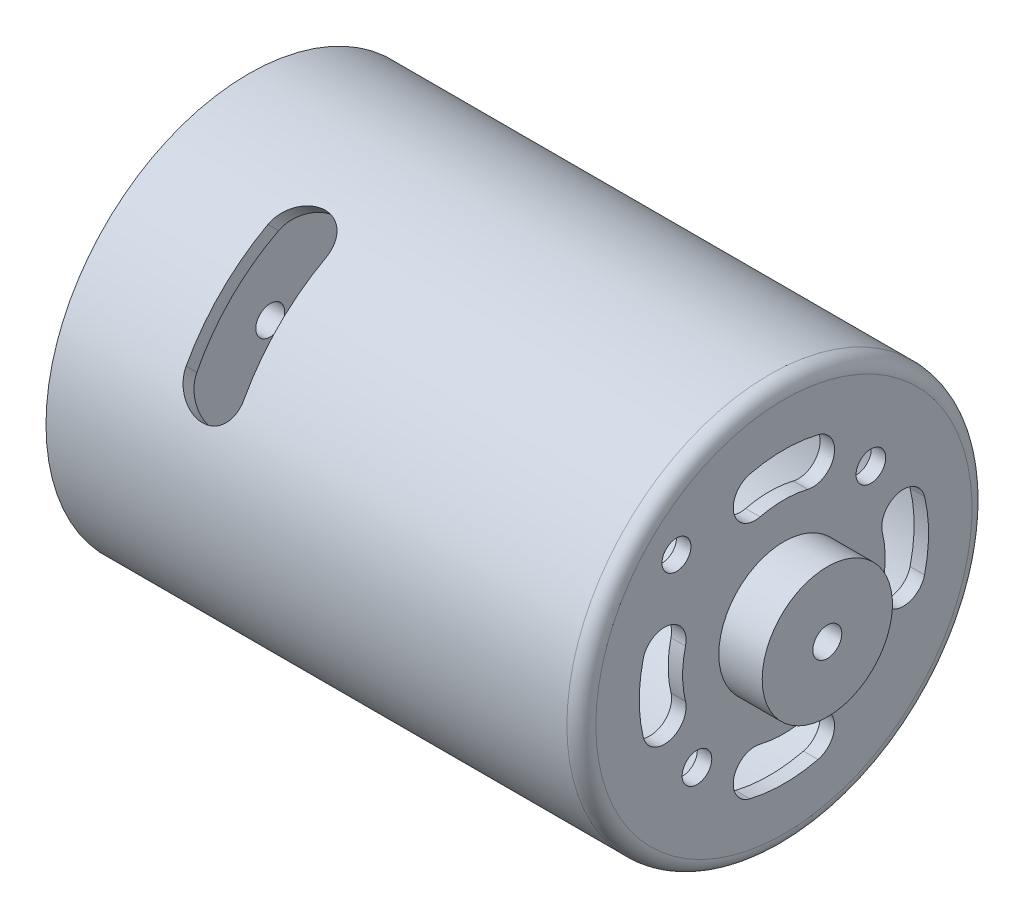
ISO-10303-21;
HEADER;
FILE_DESCRIPTION(('STEP AP214'),'2;1');
FILE_NAME('part.step','',(''),(''),'','','');
FILE_SCHEMA(('AUTOMOTIVE_DESIGN { 1 0 10303 214 1 1 1 1 }'));
ENDSEC;
DATA;
#1=APPLICATION_CONTEXT('core data for automotive mechanical design processes');
#2=APPLICATION_PROTOCOL_DEFINITION('international standard','automotive_design',2000,#1);
#3=PRODUCT_CONTEXT('',#1,'mechanical');
#4=PRODUCT('Part','Part','',(#3));
#5=PRODUCT_RELATED_PRODUCT_CATEGORY('part','',(#4));
#6=PRODUCT_DEFINITION_FORMATION('','',#4);
#7=PRODUCT_DEFINITION_CONTEXT('part definition',#1,'design');
#8=PRODUCT_DEFINITION('design','',#6,#7);
#9=PRODUCT_DEFINITION_SHAPE('','',#8);
#10=(LENGTH_UNIT() NAMED_UNIT(*) SI_UNIT(.MILLI.,.METRE.));
#11=(NAMED_UNIT(*) PLANE_ANGLE_UNIT() SI_UNIT($,.RADIAN.));
#12=(NAMED_UNIT(*) SI_UNIT($,.STERADIAN.) SOLID_ANGLE_UNIT());
#13=UNCERTAINTY_MEASURE_WITH_UNIT(LENGTH_MEASURE(1.E-05),#10,'distance_accuracy_value','');
#14=(GEOMETRIC_REPRESENTATION_CONTEXT(3) GLOBAL_UNCERTAINTY_ASSIGNED_CONTEXT((#13)) GLOBAL_UNIT_ASSIGNED_CONTEXT((#10,
#11,#12)) REPRESENTATION_CONTEXT('',''));
#15=CARTESIAN_POINT('',(0.,0.,0.));
#16=DIRECTION('',(0.,0.,1.));
#17=DIRECTION('',(1.,0.,0.));
#18=AXIS2_PLACEMENT_3D('',#15,#16,#17);
#19=CARTESIAN_POINT('',(0.,-1.,0.));
#20=DIRECTION('',(1.,0.,0.));
#21=DIRECTION('',(0.,0.,-1.));
#22=AXIS2_PLACEMENT_3D('',#19,#20,#21);
#23=PLANE('',#22);
#24=CARTESIAN_POINT('',(0.,-14.,0.));
#25=DIRECTION('',(-1.,0.,0.));
#26=DIRECTION('',(0.,0.,1.));
#27=AXIS2_PLACEMENT_3D('',#24,#25,#26);
#28=CIRCLE('',#27,13.);
#29=CARTESIAN_POINT('',(0.,-14.,13.));
#30=VERTEX_POINT('',#29);
#31=EDGE_CURVE('E214',#30,#30,#28,.T.);
#32=ORIENTED_EDGE('',*,*,#31,.F.);
#33=EDGE_LOOP('',(#32));
#34=FACE_BOUND('',#33,.T.);
#35=CARTESIAN_POINT('',(0.,-14.,0.));
#36=DIRECTION('',(-1.,0.,0.));
#37=DIRECTION('',(0.,0.,1.));
#38=AXIS2_PLACEMENT_3D('',#35,#36,#37);
#39=CIRCLE('',#38,14.);
#40=CARTESIAN_POINT('',(0.,-14.,14.));
#41=VERTEX_POINT('',#40);
#42=EDGE_CURVE('E367',#41,#41,#39,.T.);
#43=ORIENTED_EDGE('',*,*,#42,.T.);
#44=EDGE_LOOP('',(#43));
#45=FACE_BOUND('',#44,.T.);
#46=ADVANCED_FACE('F41',(#34,#45),#23,.F.);
#47=CARTESIAN_POINT('',(-1.,-14.,0.));
#48=DIRECTION('',(-1.,0.,0.));
#49=DIRECTION('',(0.,0.,1.));
#50=AXIS2_PLACEMENT_3D('',#47,#48,#49);
#51=CYLINDRICAL_SURFACE('',#50,13.);
#52=CARTESIAN_POINT('',(0.5,-14.,0.));
#53=DIRECTION('',(-1.,0.,0.));
#54=DIRECTION('',(0.,0.,1.));
#55=AXIS2_PLACEMENT_3D('',#52,#53,#54);
#56=CIRCLE('',#55,13.);
#57=CARTESIAN_POINT('',(0.5,-14.,13.));
#58=VERTEX_POINT('',#57);
#59=EDGE_CURVE('E328',#58,#58,#56,.T.);
#60=ORIENTED_EDGE('',*,*,#59,.F.);
#61=EDGE_LOOP('',(#60));
#62=FACE_BOUND('',#61,.T.);
#63=ORIENTED_EDGE('',*,*,#31,.T.);
#64=EDGE_LOOP('',(#63));
#65=FACE_BOUND('',#64,.T.);
#66=ADVANCED_FACE('F545',(#62,#65),#51,.F.);
#67=CARTESIAN_POINT('',(0.5,-1.00000000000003,0.));
#68=DIRECTION('',(1.,0.,0.));
#69=DIRECTION('',(0.,0.,-1.));
#70=AXIS2_PLACEMENT_3D('',#67,#68,#69);
#71=PLANE('',#70);
#72=CARTESIAN_POINT('',(0.5,-14.,0.));
#73=DIRECTION('',(-1.,0.,0.));
#74=DIRECTION('',(0.,0.,1.));
#75=AXIS2_PLACEMENT_3D('',#72,#73,#74);
#76=CIRCLE('',#75,4.5);
#77=CARTESIAN_POINT('',(0.5,-14.,4.5));
#78=VERTEX_POINT('',#77);
#79=EDGE_CURVE('E331',#78,#78,#76,.T.);
#80=ORIENTED_EDGE('',*,*,#79,.F.);
#81=EDGE_LOOP('',(#80));
#82=FACE_BOUND('',#81,.T.);
#83=ORIENTED_EDGE('',*,*,#59,.T.);
#84=EDGE_LOOP('',(#83));
#85=FACE_BOUND('',#84,.T.);
#86=ADVANCED_FACE('F550',(#82,#85),#71,.F.);
#87=CARTESIAN_POINT('',(-1.,-14.,0.));
#88=DIRECTION('',(-1.,0.,0.));
#89=DIRECTION('',(0.,0.,1.));
#90=AXIS2_PLACEMENT_3D('',#87,#88,#89);
#91=CYLINDRICAL_SURFACE('',#90,4.5);
#92=CARTESIAN_POINT('',(-2.5,-14.,0.));
#93=DIRECTION('',(-1.,0.,0.));
#94=DIRECTION('',(0.,0.,1.));
#95=AXIS2_PLACEMENT_3D('',#92,#93,#94);
#96=CIRCLE('',#95,4.5);
#97=CARTESIAN_POINT('',(-2.5,-14.,4.5));
#98=VERTEX_POINT('',#97);
#99=EDGE_CURVE('E334',#98,#98,#96,.T.);
#100=ORIENTED_EDGE('',*,*,#99,.F.);
#101=EDGE_LOOP('',(#100));
#102=FACE_BOUND('',#101,.T.);
#103=ORIENTED_EDGE('',*,*,#79,.T.);
#104=EDGE_LOOP('',(#103));
#105=FACE_BOUND('',#104,.T.);
#106=ADVANCED_FACE('F608',(#102,#105),#91,.T.);
#107=CARTESIAN_POINT('',(-2.5,-9.5,0.));
#108=DIRECTION('',(1.,0.,0.));
#109=DIRECTION('',(0.,0.,-1.));
#110=AXIS2_PLACEMENT_3D('',#107,#108,#109);
#111=PLANE('',#110);
#112=CARTESIAN_POINT('',(-2.5,-14.,0.));
#113=DIRECTION('',(-1.,0.,0.));
#114=DIRECTION('',(0.,0.,1.));
#115=AXIS2_PLACEMENT_3D('',#112,#113,#114);
#116=CIRCLE('',#115,0.999999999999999);
#117=CARTESIAN_POINT('',(-2.5,-14.,0.999999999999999));
#118=VERTEX_POINT('',#117);
#119=EDGE_CURVE('E337',#118,#118,#116,.T.);
#120=ORIENTED_EDGE('',*,*,#119,.F.);
#121=EDGE_LOOP('',(#120));
#122=FACE_BOUND('',#121,.T.);
#123=ORIENTED_EDGE('',*,*,#99,.T.);
#124=EDGE_LOOP('',(#123));
#125=FACE_BOUND('',#124,.T.);
#126=ADVANCED_FACE('F603',(#122,#125),#111,.F.);
#127=CARTESIAN_POINT('',(-1.,-14.,0.));
#128=DIRECTION('',(-1.,0.,0.));
#129=DIRECTION('',(0.,0.,1.));
#130=AXIS2_PLACEMENT_3D('',#127,#128,#129);
#131=CYLINDRICAL_SURFACE('',#130,0.999999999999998);
#132=CARTESIAN_POINT('',(1.5,-14.,0.));
#133=DIRECTION('',(-1.,0.,0.));
#134=DIRECTION('',(0.,0.,1.));
#135=AXIS2_PLACEMENT_3D('',#132,#133,#134);
#136=CIRCLE('',#135,0.999999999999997);
#137=CARTESIAN_POINT('',(1.5,-14.,0.999999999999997));
#138=VERTEX_POINT('',#137);
#139=EDGE_CURVE('E340',#138,#138,#136,.T.);
#140=ORIENTED_EDGE('',*,*,#139,.F.);
#141=EDGE_LOOP('',(#140));
#142=FACE_BOUND('',#141,.T.);
#143=ORIENTED_EDGE('',*,*,#119,.T.);
#144=EDGE_LOOP('',(#143));
#145=FACE_BOUND('',#144,.T.);
#146=ADVANCED_FACE('F598',(#142,#145),#131,.F.);
#147=CARTESIAN_POINT('',(1.5,-13.,0.));
#148=DIRECTION('',(-1.,0.,0.));
#149=DIRECTION('',(0.,0.,1.));
#150=AXIS2_PLACEMENT_3D('',#147,#148,#149);
#151=PLANE('',#150);
#152=CARTESIAN_POINT('',(1.5,-14.,0.));
#153=DIRECTION('',(-1.,0.,0.));
#154=DIRECTION('',(0.,0.,1.));
#155=AXIS2_PLACEMENT_3D('',#152,#153,#154);
#156=CIRCLE('',#155,13.);
#157=CARTESIAN_POINT('',(1.5,-14.,13.));
#158=VERTEX_POINT('',#157);
#159=EDGE_CURVE('E343',#158,#158,#156,.T.);
#160=ORIENTED_EDGE('',*,*,#159,.F.);
#161=EDGE_LOOP('',(#160));
#162=FACE_BOUND('',#161,.T.);
#163=ORIENTED_EDGE('',*,*,#139,.T.);
#164=EDGE_LOOP('',(#163));
#165=FACE_BOUND('',#164,.T.);
#166=ADVANCED_FACE('F283',(#162,#165),#151,.F.);
#167=CARTESIAN_POINT('',(-1.,-14.,0.));
#168=DIRECTION('',(-1.,0.,0.));
#169=DIRECTION('',(0.,0.,1.));
#170=AXIS2_PLACEMENT_3D('',#167,#168,#169);
#171=CYLINDRICAL_SURFACE('',#170,13.);
#172=CARTESIAN_POINT('',(12.,-14.,0.));
#173=DIRECTION('',(1.,0.,0.));
#174=DIRECTION('',(0.,0.,-1.));
#175=AXIS2_PLACEMENT_3D('',#172,#173,#174);
#176=CIRCLE('',#175,13.);
#177=CARTESIAN_POINT('',(12.,-19.9180007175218,-11.5748549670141));
#178=VERTEX_POINT('',#177);
#179=CARTESIAN_POINT('',(12.,-25.5748549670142,-5.91800071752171));
#180=VERTEX_POINT('',#179);
#181=EDGE_CURVE('E509',#178,#180,#176,.F.);
#182=ORIENTED_EDGE('',*,*,#181,.T.);
#183=CARTESIAN_POINT('',(12.,-25.5748549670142,-5.91800071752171));
#184=CARTESIAN_POINT('',(11.9999983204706,-25.6035219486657,-5.86193744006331));
#185=CARTESIAN_POINT('',(11.9973067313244,-25.6317602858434,-5.80569502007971));
#186=CARTESIAN_POINT('',(11.9866365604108,-25.687219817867,-5.69322523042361));
#187=CARTESIAN_POINT('',(11.9786591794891,-25.7144412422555,-5.63699786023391));
#188=CARTESIAN_POINT('',(11.9469692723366,-25.7942750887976,-5.46903778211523));
#189=CARTESIAN_POINT('',(11.9154983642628,-25.8451491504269,-5.35784666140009));
#190=CARTESIAN_POINT('',(11.8329986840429,-25.9410940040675,-5.14046923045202));
#191=CARTESIAN_POINT('',(11.781977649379,-25.9861670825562,-5.03428095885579));
#192=CARTESIAN_POINT('',(11.661606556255,-26.0699298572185,-4.83000817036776));
#193=CARTESIAN_POINT('',(11.5922518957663,-26.1086179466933,-4.73192569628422));
#194=CARTESIAN_POINT('',(11.4360789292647,-26.1794024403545,-4.5466553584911));
#195=CARTESIAN_POINT('',(11.3491368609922,-26.211448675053,-4.45955223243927));
#196=CARTESIAN_POINT('',(11.1599687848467,-26.268232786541,-4.30088129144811));
#197=CARTESIAN_POINT('',(11.05774866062,-26.2929734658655,-4.22930752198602));
#198=CARTESIAN_POINT('',(10.847820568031,-26.3334530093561,-4.10970527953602));
#199=CARTESIAN_POINT('',(10.7409151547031,-26.3496767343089,-4.0604382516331));
#200=CARTESIAN_POINT('',(10.5192305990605,-26.3752131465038,-3.98193828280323));
#201=CARTESIAN_POINT('',(10.4044593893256,-26.3845326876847,-3.95268547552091));
#202=CARTESIAN_POINT('',(10.1836672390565,-26.3954781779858,-3.91821455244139));
#203=CARTESIAN_POINT('',(10.0780282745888,-26.3978221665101,-3.91075488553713));
#204=CARTESIAN_POINT('',(9.8670577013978,-26.3968377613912,-3.91387539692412));
#205=CARTESIAN_POINT('',(9.76172601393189,-26.393510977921,-3.92445045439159));
#206=CARTESIAN_POINT('',(9.55998290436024,-26.3815618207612,-3.96197907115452));
#207=CARTESIAN_POINT('',(9.46339089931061,-26.3732193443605,-3.98806619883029));
#208=CARTESIAN_POINT('',(9.27585851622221,-26.3516008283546,-4.05452464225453));
#209=CARTESIAN_POINT('',(9.18491905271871,-26.3383239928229,-4.09489826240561));
#210=CARTESIAN_POINT('',(9.00652272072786,-26.306245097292,-4.19034275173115));
#211=CARTESIAN_POINT('',(8.91943070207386,-26.2872125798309,-4.24601546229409));
#212=CARTESIAN_POINT('',(8.75518215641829,-26.2440803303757,-4.36883614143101));
#213=CARTESIAN_POINT('',(8.67802892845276,-26.2199789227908,-4.43598790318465));
#214=CARTESIAN_POINT('',(8.52769647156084,-26.1642350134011,-4.58677035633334));
#215=CARTESIAN_POINT('',(8.45568650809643,-26.13207936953,-4.67137747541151));
#216=CARTESIAN_POINT('',(8.32635975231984,-26.0621321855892,-4.84913339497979));
#217=CARTESIAN_POINT('',(8.26905462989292,-26.0243362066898,-4.94228890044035));
#218=CARTESIAN_POINT('',(8.1661513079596,-25.9401775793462,-5.1424595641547));
#219=CARTESIAN_POINT('',(8.12190950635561,-25.8933653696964,-5.24998406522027));
#220=CARTESIAN_POINT('',(8.05318723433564,-25.7943912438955,-5.46869993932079));
#221=CARTESIAN_POINT('',(8.02867580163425,-25.7422378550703,-5.57988528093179));
#222=CARTESIAN_POINT('',(8.0096786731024,-25.6695984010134,-5.72907213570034));
#223=CARTESIAN_POINT('',(8.00605313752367,-25.6509293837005,-5.76694369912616));
#224=CARTESIAN_POINT('',(8.00121662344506,-25.6131889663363,-5.84256953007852));
#225=CARTESIAN_POINT('',(8.00000205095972,-25.5941182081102,-5.8803238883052));
#226=CARTESIAN_POINT('',(7.99999999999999,-25.5748549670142,-5.91800071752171));
#227=B_SPLINE_CURVE_WITH_KNOTS('',3,(#183,#184,#185,#186,#187,#188,#189,#190,#191,#192,#193,
#194,#195,#196,#197,#198,#199,#200,#201,#202,#203,#204,#205,#206,#207,#208,#209,#210,#211,#212,
#213,#214,#215,#216,#217,#218,#219,#220,#221,#222,#223,#224,#225,#226),.UNSPECIFIED.,.F.,.F.,(4,
2,2,2,2,2,2,2,2,2,2,2,2,2,2,2,2,2,2,2,2,4),(0.,0.188775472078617,0.377508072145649,
0.754373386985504,1.13108970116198,1.50790066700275,1.88746174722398,2.26687703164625,
2.62134926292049,2.97546912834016,3.29160340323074,3.60764792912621,3.9075086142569,
4.20741768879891,4.52142953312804,4.83554534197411,5.18107812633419,5.52688428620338,
5.90122833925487,6.27498379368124,6.40206602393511,6.52895867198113),.UNSPECIFIED.);
#228=CARTESIAN_POINT('',(8.,-25.5748549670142,-5.91800071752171));
#229=VERTEX_POINT('',#228);
#230=EDGE_CURVE('E223',#180,#229,#227,.T.);
#231=ORIENTED_EDGE('',*,*,#230,.T.);
#232=CARTESIAN_POINT('',(8.,-14.,0.));
#233=DIRECTION('',(-1.,0.,0.));
#234=DIRECTION('',(0.,0.,1.));
#235=AXIS2_PLACEMENT_3D('',#232,#233,#234);
#236=CIRCLE('',#235,13.);
#237=CARTESIAN_POINT('',(8.,-19.9180007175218,-11.5748549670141));
#238=VERTEX_POINT('',#237);
#239=EDGE_CURVE('E269',#229,#238,#236,.F.);
#240=ORIENTED_EDGE('',*,*,#239,.T.);
#241=CARTESIAN_POINT('',(8.,-19.9180007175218,-11.5748549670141));
#242=CARTESIAN_POINT('',(8.00000167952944,-19.8619374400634,-11.6035219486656));
#243=CARTESIAN_POINT('',(8.00269326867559,-19.8056950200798,-11.6317602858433));
#244=CARTESIAN_POINT('',(8.01336343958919,-19.6932252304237,-11.687219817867));
#245=CARTESIAN_POINT('',(8.02134082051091,-19.636997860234,-11.7144412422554));
#246=CARTESIAN_POINT('',(8.05303072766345,-19.4690377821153,-11.7942750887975));
#247=CARTESIAN_POINT('',(8.08450163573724,-19.3578466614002,-11.8451491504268));
#248=CARTESIAN_POINT('',(8.16700131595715,-19.1404692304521,-11.9410940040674));
#249=CARTESIAN_POINT('',(8.21802235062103,-19.0342809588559,-11.9861670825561));
#250=CARTESIAN_POINT('',(8.33839344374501,-18.8300081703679,-12.0699298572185));
#251=CARTESIAN_POINT('',(8.40774810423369,-18.7319256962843,-12.1086179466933));
#252=CARTESIAN_POINT('',(8.56392107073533,-18.5466553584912,-12.1794024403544));
#253=CARTESIAN_POINT('',(8.65086313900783,-18.4595522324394,-12.2114486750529));
#254=CARTESIAN_POINT('',(8.84003121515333,-18.3008812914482,-12.268232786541));
#255=CARTESIAN_POINT('',(8.94225133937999,-18.2293075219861,-12.2929734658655));
#256=CARTESIAN_POINT('',(9.152179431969,-18.1097052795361,-12.3334530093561));
#257=CARTESIAN_POINT('',(9.25908484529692,-18.0604382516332,-12.3496767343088));
#258=CARTESIAN_POINT('',(9.48076940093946,-17.9819382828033,-12.3752131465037));
#259=CARTESIAN_POINT('',(9.59554061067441,-17.952685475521,-12.3845326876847));
#260=CARTESIAN_POINT('',(9.81633276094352,-17.9182145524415,-12.3954781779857));
#261=CARTESIAN_POINT('',(9.92197172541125,-17.9107548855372,-12.3978221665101));
#262=CARTESIAN_POINT('',(10.1329422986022,-17.9138753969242,-12.3968377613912));
#263=CARTESIAN_POINT('',(10.2382739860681,-17.9244504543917,-12.3935109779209));
#264=CARTESIAN_POINT('',(10.4400170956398,-17.9619790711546,-12.3815618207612));
#265=CARTESIAN_POINT('',(10.5366091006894,-17.9880661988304,-12.3732193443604));
#266=CARTESIAN_POINT('',(10.7241414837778,-18.0545246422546,-12.3516008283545));
#267=CARTESIAN_POINT('',(10.8150809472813,-18.0948982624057,-12.3383239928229));
#268=CARTESIAN_POINT('',(10.9934772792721,-18.1903427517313,-12.306245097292));
#269=CARTESIAN_POINT('',(11.0805692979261,-18.2460154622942,-12.2872125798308));
#270=CARTESIAN_POINT('',(11.2448178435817,-18.3688361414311,-12.2440803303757));
#271=CARTESIAN_POINT('',(11.3219710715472,-18.4359879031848,-12.2199789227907));
#272=CARTESIAN_POINT('',(11.4723035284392,-18.5867703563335,-12.164235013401));
#273=CARTESIAN_POINT('',(11.5443134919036,-18.6713774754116,-12.13207936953));
#274=CARTESIAN_POINT('',(11.6736402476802,-18.8491333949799,-12.0621321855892));
#275=CARTESIAN_POINT('',(11.7309453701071,-18.9422889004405,-12.0243362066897));
#276=CARTESIAN_POINT('',(11.8338486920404,-19.1424595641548,-11.9401775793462));
#277=CARTESIAN_POINT('',(11.8780904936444,-19.2499840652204,-11.8933653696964));
#278=CARTESIAN_POINT('',(11.9468127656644,-19.4686999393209,-11.7943912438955));
#279=CARTESIAN_POINT('',(11.9713241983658,-19.5798852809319,-11.7422378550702));
#280=CARTESIAN_POINT('',(11.9903213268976,-19.7290721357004,-11.6695984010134));
#281=CARTESIAN_POINT('',(11.9939468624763,-19.7669436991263,-11.6509293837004));
#282=CARTESIAN_POINT('',(11.9987833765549,-19.8425695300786,-11.6131889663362));
#283=CARTESIAN_POINT('',(11.9999979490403,-19.8803238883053,-11.5941182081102));
#284=CARTESIAN_POINT('',(12.,-19.9180007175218,-11.5748549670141));
#285=B_SPLINE_CURVE_WITH_KNOTS('',3,(#241,#242,#243,#244,#245,#246,#247,#248,#249,#250,#251,
#252,#253,#254,#255,#256,#257,#258,#259,#260,#261,#262,#263,#264,#265,#266,#267,#268,#269,#270,
#271,#272,#273,#274,#275,#276,#277,#278,#279,#280,#281,#282,#283,#284),.UNSPECIFIED.,.F.,.F.,(4,
2,2,2,2,2,2,2,2,2,2,2,2,2,2,2,2,2,2,2,2,4),(0.,0.188775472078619,0.37750807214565,
0.754373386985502,1.13108970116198,1.50790066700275,1.88746174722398,2.26687703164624,
2.62134926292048,2.97546912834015,3.29160340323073,3.6076479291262,3.90750861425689,
4.2074176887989,4.52142953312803,4.8355453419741,5.18107812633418,5.52688428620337,
5.90122833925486,6.27498379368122,6.4020660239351,6.52895867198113),.UNSPECIFIED.);
#286=EDGE_CURVE('E297',#238,#178,#285,.T.);
#287=ORIENTED_EDGE('',*,*,#286,.T.);
#288=EDGE_LOOP('',(#182,#231,#240,#287));
#289=FACE_BOUND('',#288,.T.);
#290=CARTESIAN_POINT('',(8.,-2.42514503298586,5.91800071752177));
#291=VERTEX_POINT('',#290);
#292=CARTESIAN_POINT('',(8.,-8.08199928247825,11.5748549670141));
#293=VERTEX_POINT('',#292);
#294=EDGE_CURVE('E270',#291,#293,#236,.F.);
#295=ORIENTED_EDGE('',*,*,#294,.T.);
#296=CARTESIAN_POINT('',(8.,-8.08199928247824,11.5748549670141));
#297=CARTESIAN_POINT('',(8.00000167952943,-8.13806255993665,11.6035219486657));
#298=CARTESIAN_POINT('',(8.00269326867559,-8.19430497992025,11.6317602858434));
#299=CARTESIAN_POINT('',(8.01336343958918,-8.30677476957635,11.687219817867));
#300=CARTESIAN_POINT('',(8.02134082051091,-8.36300213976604,11.7144412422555));
#301=CARTESIAN_POINT('',(8.05303072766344,-8.53096221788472,11.7942750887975));
#302=CARTESIAN_POINT('',(8.08450163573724,-8.64215333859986,11.8451491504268));
#303=CARTESIAN_POINT('',(8.16700131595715,-8.85953076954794,11.9410940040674));
#304=CARTESIAN_POINT('',(8.21802235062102,-8.96571904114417,11.9861670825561));
#305=CARTESIAN_POINT('',(8.33839344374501,-9.1699918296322,12.0699298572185));
#306=CARTESIAN_POINT('',(8.40774810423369,-9.26807430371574,12.1086179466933));
#307=CARTESIAN_POINT('',(8.56392107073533,-9.45334464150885,12.1794024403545));
#308=CARTESIAN_POINT('',(8.65086313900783,-9.54044776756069,12.211448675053));
#309=CARTESIAN_POINT('',(8.84003121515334,-9.69911870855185,12.268232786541));
#310=CARTESIAN_POINT('',(8.94225133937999,-9.77069247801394,12.2929734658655));
#311=CARTESIAN_POINT('',(9.15217943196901,-9.89029472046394,12.3334530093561));
#312=CARTESIAN_POINT('',(9.25908484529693,-9.93956174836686,12.3496767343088));
#313=CARTESIAN_POINT('',(9.48076940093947,-10.0180617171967,12.3752131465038));
#314=CARTESIAN_POINT('',(9.59554061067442,-10.047314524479,12.3845326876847));
#315=CARTESIAN_POINT('',(9.81633276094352,-10.0817854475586,12.3954781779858));
#316=CARTESIAN_POINT('',(9.92197172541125,-10.0892451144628,12.3978221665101));
#317=CARTESIAN_POINT('',(10.1329422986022,-10.0861246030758,12.3968377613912));
#318=CARTESIAN_POINT('',(10.2382739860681,-10.0755495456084,12.393510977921));
#319=CARTESIAN_POINT('',(10.4400170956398,-10.0380209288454,12.3815618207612));
#320=CARTESIAN_POINT('',(10.5366091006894,-10.0119338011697,12.3732193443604));
#321=CARTESIAN_POINT('',(10.7241414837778,-9.94547535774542,12.3516008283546));
#322=CARTESIAN_POINT('',(10.8150809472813,-9.90510173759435,12.3383239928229));
#323=CARTESIAN_POINT('',(10.9934772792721,-9.8096572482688,12.306245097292));
#324=CARTESIAN_POINT('',(11.0805692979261,-9.75398453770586,12.2872125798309));
#325=CARTESIAN_POINT('',(11.2448178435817,-9.63116385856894,12.2440803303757));
#326=CARTESIAN_POINT('',(11.3219710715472,-9.56401209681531,12.2199789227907));
#327=CARTESIAN_POINT('',(11.4723035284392,-9.41322964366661,12.164235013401));
#328=CARTESIAN_POINT('',(11.5443134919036,-9.32862252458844,12.13207936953));
#329=CARTESIAN_POINT('',(11.6736402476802,-9.15086660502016,12.0621321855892));
#330=CARTESIAN_POINT('',(11.7309453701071,-9.0577110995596,12.0243362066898));
#331=CARTESIAN_POINT('',(11.8338486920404,-8.85754043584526,11.9401775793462));
#332=CARTESIAN_POINT('',(11.8780904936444,-8.75001593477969,11.8933653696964));
#333=CARTESIAN_POINT('',(11.9468127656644,-8.53130006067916,11.7943912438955));
#334=CARTESIAN_POINT('',(11.9713241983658,-8.42011471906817,11.7422378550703));
#335=CARTESIAN_POINT('',(11.9903213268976,-8.27092786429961,11.6695984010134));
#336=CARTESIAN_POINT('',(11.9939468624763,-8.2330563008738,11.6509293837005));
#337=CARTESIAN_POINT('',(11.9987833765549,-8.15743046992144,11.6131889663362));
#338=CARTESIAN_POINT('',(11.9999979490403,-8.11967611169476,11.5941182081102));
#339=CARTESIAN_POINT('',(12.,-8.08199928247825,11.5748549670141));
#340=B_SPLINE_CURVE_WITH_KNOTS('',3,(#296,#297,#298,#299,#300,#301,#302,#303,#304,#305,#306,
#307,#308,#309,#310,#311,#312,#313,#314,#315,#316,#317,#318,#319,#320,#321,#322,#323,#324,#325,
#326,#327,#328,#329,#330,#331,#332,#333,#334,#335,#336,#337,#338,#339),.UNSPECIFIED.,.F.,.F.,(4,
2,2,2,2,2,2,2,2,2,2,2,2,2,2,2,2,2,2,2,2,4),(0.,0.188775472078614,0.377508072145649,
0.754373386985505,1.13108970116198,1.50790066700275,1.88746174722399,2.26687703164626,
2.62134926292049,2.97546912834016,3.29160340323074,3.60764792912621,3.9075086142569,
4.20741768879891,4.52142953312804,4.83554534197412,5.18107812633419,5.52688428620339,
5.90122833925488,6.27498379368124,6.40206602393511,6.52895867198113),.UNSPECIFIED.);
#341=CARTESIAN_POINT('',(12.,-8.08199928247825,11.5748549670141));
#342=VERTEX_POINT('',#341);
#343=EDGE_CURVE('E261',#293,#342,#340,.T.);
#344=ORIENTED_EDGE('',*,*,#343,.T.);
#345=CARTESIAN_POINT('',(12.,-2.42514503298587,5.91800071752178));
#346=VERTEX_POINT('',#345);
#347=EDGE_CURVE('E510',#342,#346,#176,.F.);
#348=ORIENTED_EDGE('',*,*,#347,.T.);
#349=CARTESIAN_POINT('',(12.,-2.42514503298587,5.91800071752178));
#350=CARTESIAN_POINT('',(11.9999983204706,-2.39647805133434,5.86193744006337));
#351=CARTESIAN_POINT('',(11.9973067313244,-2.36823971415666,5.80569502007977));
#352=CARTESIAN_POINT('',(11.9866365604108,-2.31278018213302,5.69322523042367));
#353=CARTESIAN_POINT('',(11.9786591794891,-2.28555875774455,5.63699786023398));
#354=CARTESIAN_POINT('',(11.9469692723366,-2.20572491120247,5.4690377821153));
#355=CARTESIAN_POINT('',(11.9154983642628,-2.15485084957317,5.35784666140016));
#356=CARTESIAN_POINT('',(11.8329986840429,-2.05890599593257,5.14046923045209));
#357=CARTESIAN_POINT('',(11.781977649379,-2.01383291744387,5.03428095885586));
#358=CARTESIAN_POINT('',(11.661606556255,-1.93007014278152,4.83000817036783));
#359=CARTESIAN_POINT('',(11.5922518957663,-1.89138205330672,4.73192569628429));
#360=CARTESIAN_POINT('',(11.4360789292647,-1.82059755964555,4.54665535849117));
#361=CARTESIAN_POINT('',(11.3491368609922,-1.78855132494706,4.45955223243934));
#362=CARTESIAN_POINT('',(11.1599687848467,-1.73176721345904,4.30088129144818));
#363=CARTESIAN_POINT('',(11.05774866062,-1.70702653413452,4.22930752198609));
#364=CARTESIAN_POINT('',(10.847820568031,-1.66654699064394,4.10970527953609));
#365=CARTESIAN_POINT('',(10.7409151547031,-1.65032326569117,4.06043825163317));
#366=CARTESIAN_POINT('',(10.5192305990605,-1.62478685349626,3.9819382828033));
#367=CARTESIAN_POINT('',(10.4044593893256,-1.61546731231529,3.95268547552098));
#368=CARTESIAN_POINT('',(10.1836672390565,-1.60452182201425,3.91821455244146));
#369=CARTESIAN_POINT('',(10.0780282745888,-1.60217783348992,3.9107548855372));
#370=CARTESIAN_POINT('',(9.86705770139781,-1.60316223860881,3.91387539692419));
#371=CARTESIAN_POINT('',(9.7617260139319,-1.60648902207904,3.92445045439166));
#372=CARTESIAN_POINT('',(9.55998290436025,-1.61843817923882,3.96197907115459));
#373=CARTESIAN_POINT('',(9.46339089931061,-1.62678065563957,3.98806619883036));
#374=CARTESIAN_POINT('',(9.27585851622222,-1.64839917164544,4.0545246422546));
#375=CARTESIAN_POINT('',(9.18491905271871,-1.6616760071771,4.09489826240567));
#376=CARTESIAN_POINT('',(9.00652272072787,-1.693754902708,4.19034275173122));
#377=CARTESIAN_POINT('',(8.91943070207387,-1.71278742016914,4.24601546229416));
#378=CARTESIAN_POINT('',(8.7551821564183,-1.75591966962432,4.36883614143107));
#379=CARTESIAN_POINT('',(8.67802892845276,-1.78002107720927,4.43598790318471));
#380=CARTESIAN_POINT('',(8.52769647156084,-1.83576498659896,4.5867703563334));
#381=CARTESIAN_POINT('',(8.45568650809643,-1.86792063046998,4.67137747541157));
#382=CARTESIAN_POINT('',(8.32635975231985,-1.93786781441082,4.84913339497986));
#383=CARTESIAN_POINT('',(8.26905462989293,-1.97566379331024,4.94228890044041));
#384=CARTESIAN_POINT('',(8.16615130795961,-2.0598224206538,5.14245956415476));
#385=CARTESIAN_POINT('',(8.12190950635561,-2.10663463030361,5.24998406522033));
#386=CARTESIAN_POINT('',(8.05318723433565,-2.20560875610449,5.46869993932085));
#387=CARTESIAN_POINT('',(8.02867580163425,-2.25776214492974,5.57988528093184));
#388=CARTESIAN_POINT('',(8.00967867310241,-2.33040159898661,5.7290721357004));
#389=CARTESIAN_POINT('',(8.00605313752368,-2.34907061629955,5.76694369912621));
#390=CARTESIAN_POINT('',(8.00121662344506,-2.38681103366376,5.84256953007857));
#391=CARTESIAN_POINT('',(8.00000205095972,-2.40588179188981,5.88032388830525));
#392=CARTESIAN_POINT('',(7.99999999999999,-2.42514503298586,5.91800071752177));
#393=B_SPLINE_CURVE_WITH_KNOTS('',3,(#349,#350,#351,#352,#353,#354,#355,#356,#357,#358,#359,
#360,#361,#362,#363,#364,#365,#366,#367,#368,#369,#370,#371,#372,#373,#374,#375,#376,#377,#378,
#379,#380,#381,#382,#383,#384,#385,#386,#387,#388,#389,#390,#391,#392),.UNSPECIFIED.,.F.,.F.,(4,
2,2,2,2,2,2,2,2,2,2,2,2,2,2,2,2,2,2,2,2,4),(0.,0.188775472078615,0.377508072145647,
0.754373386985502,1.13108970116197,1.50790066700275,1.88746174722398,2.26687703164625,
2.62134926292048,2.97546912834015,3.29160340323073,3.6076479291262,3.90750861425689,
4.2074176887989,4.52142953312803,4.83554534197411,5.18107812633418,5.52688428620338,
5.90122833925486,6.27498379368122,6.4020660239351,6.52895867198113),.UNSPECIFIED.);
#394=EDGE_CURVE('E290',#346,#291,#393,.T.);
#395=ORIENTED_EDGE('',*,*,#394,.T.);
#396=EDGE_LOOP('',(#295,#344,#348,#395));
#397=FACE_BOUND('',#396,.T.);
#398=CARTESIAN_POINT('',(36.,-14.,0.));
#399=DIRECTION('',(-1.,0.,0.));
#400=DIRECTION('',(0.,0.,1.));
#401=AXIS2_PLACEMENT_3D('',#398,#399,#400);
#402=CIRCLE('',#401,13.);
#403=CARTESIAN_POINT('',(36.,-14.,13.));
#404=VERTEX_POINT('',#403);
#405=EDGE_CURVE('E346',#404,#404,#402,.T.);
#406=ORIENTED_EDGE('',*,*,#405,.F.);
#407=EDGE_LOOP('',(#406));
#408=FACE_BOUND('',#407,.T.);
#409=ORIENTED_EDGE('',*,*,#159,.T.);
#410=EDGE_LOOP('',(#409));
#411=FACE_BOUND('',#410,.T.);
#412=ADVANCED_FACE('F277',(#289,#397,#408,#411),#171,.F.);
#413=CARTESIAN_POINT('',(36.,-13.,0.));
#414=DIRECTION('',(1.,0.,0.));
#415=DIRECTION('',(0.,0.,-1.));
#416=AXIS2_PLACEMENT_3D('',#413,#414,#415);
#417=PLANE('',#416);
#418=CARTESIAN_POINT('',(36.,-6.57537879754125,7.42462120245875));
#419=DIRECTION('',(1.,0.,0.));
#420=DIRECTION('',(0.,0.,-1.));
#421=AXIS2_PLACEMENT_3D('',#418,#419,#420);
#422=CIRCLE('',#421,1.);
#423=CARTESIAN_POINT('',(36.,-6.57537879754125,6.42462120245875));
#424=VERTEX_POINT('',#423);
#425=EDGE_CURVE('E501',#424,#424,#422,.T.);
#426=ORIENTED_EDGE('',*,*,#425,.T.);
#427=EDGE_LOOP('',(#426));
#428=FACE_BOUND('',#427,.T.);
#429=CARTESIAN_POINT('',(36.,-20.0104076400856,6.0104076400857));
#430=DIRECTION('',(1.,0.,0.));
#431=DIRECTION('',(0.,0.,-1.));
#432=AXIS2_PLACEMENT_3D('',#429,#430,#431);
#433=CIRCLE('',#432,1.02499999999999);
#434=CARTESIAN_POINT('',(36.,-20.0104076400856,4.98540764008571));
#435=VERTEX_POINT('',#434);
#436=EDGE_CURVE('E317',#435,#435,#433,.T.);
#437=ORIENTED_EDGE('',*,*,#436,.T.);
#438=EDGE_LOOP('',(#437));
#439=FACE_BOUND('',#438,.T.);
#440=CARTESIAN_POINT('',(36.,-7.98959235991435,-6.01040764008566));
#441=DIRECTION('',(1.,0.,0.));
#442=DIRECTION('',(0.,0.,-1.));
#443=AXIS2_PLACEMENT_3D('',#440,#441,#442);
#444=CIRCLE('',#443,1.02499999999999);
#445=CARTESIAN_POINT('',(36.,-7.98959235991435,-7.03540764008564));
#446=VERTEX_POINT('',#445);
#447=EDGE_CURVE('E322',#446,#446,#444,.T.);
#448=ORIENTED_EDGE('',*,*,#447,.T.);
#449=EDGE_LOOP('',(#448));
#450=FACE_BOUND('',#449,.T.);
#451=CARTESIAN_POINT('',(36.,-15.9999999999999,8.26135582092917));
#452=DIRECTION('',(1.,0.,0.));
#453=DIRECTION('',(0.,0.,-1.));
#454=AXIS2_PLACEMENT_3D('',#451,#452,#453);
#455=CIRCLE('',#454,1.5);
#456=CARTESIAN_POINT('',(36.,-16.3529411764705,9.71924214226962));
#457=VERTEX_POINT('',#456);
#458=CARTESIAN_POINT('',(36.,-15.6470588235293,6.80346949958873));
#459=VERTEX_POINT('',#458);
#460=EDGE_CURVE('E469',#457,#459,#455,.T.);
#461=ORIENTED_EDGE('',*,*,#460,.T.);
#462=CARTESIAN_POINT('',(36.,-14.,0.));
#463=DIRECTION('',(1.,0.,0.));
#464=DIRECTION('',(0.,0.,-1.));
#465=AXIS2_PLACEMENT_3D('',#462,#463,#464);
#466=CIRCLE('',#465,7.);
#467=CARTESIAN_POINT('',(36.,-12.3529411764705,6.8034694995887));
#468=VERTEX_POINT('',#467);
#469=EDGE_CURVE('E466',#459,#468,#466,.F.);
#470=ORIENTED_EDGE('',*,*,#469,.T.);
#471=CARTESIAN_POINT('',(36.,-11.9999999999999,8.26135582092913));
#472=DIRECTION('',(1.,0.,0.));
#473=DIRECTION('',(0.,0.,-1.));
#474=AXIS2_PLACEMENT_3D('',#471,#472,#473);
#475=CIRCLE('',#474,1.5);
#476=CARTESIAN_POINT('',(36.,-11.6470588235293,9.71924214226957));
#477=VERTEX_POINT('',#476);
#478=EDGE_CURVE('E475',#468,#477,#475,.T.);
#479=ORIENTED_EDGE('',*,*,#478,.T.);
#480=CARTESIAN_POINT('',(36.,-14.,0.));
#481=DIRECTION('',(1.,0.,0.));
#482=DIRECTION('',(0.,0.,-1.));
#483=AXIS2_PLACEMENT_3D('',#480,#481,#482);
#484=CIRCLE('',#483,10.);
#485=EDGE_CURVE('E472',#477,#457,#484,.T.);
#486=ORIENTED_EDGE('',*,*,#485,.T.);
#487=EDGE_LOOP('',(#461,#470,#479,#486));
#488=FACE_BOUND('',#487,.T.);
#489=CARTESIAN_POINT('',(36.,-22.2613558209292,-1.99999999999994));
#490=DIRECTION('',(1.,0.,0.));
#491=DIRECTION('',(0.,0.,-1.));
#492=AXIS2_PLACEMENT_3D('',#489,#490,#491);
#493=CIRCLE('',#492,1.5);
#494=CARTESIAN_POINT('',(36.,-23.7192421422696,-2.35294117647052));
#495=VERTEX_POINT('',#494);
#496=CARTESIAN_POINT('',(36.,-20.8034694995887,-1.64705882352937));
#497=VERTEX_POINT('',#496);
#498=EDGE_CURVE('E437',#495,#497,#493,.T.);
#499=ORIENTED_EDGE('',*,*,#498,.T.);
#500=CARTESIAN_POINT('',(36.,-14.,0.));
#501=DIRECTION('',(1.,0.,0.));
#502=DIRECTION('',(0.,0.,-1.));
#503=AXIS2_PLACEMENT_3D('',#500,#501,#502);
#504=CIRCLE('',#503,7.);
#505=CARTESIAN_POINT('',(36.,-20.8034694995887,1.64705882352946));
#506=VERTEX_POINT('',#505);
#507=EDGE_CURVE('E434',#497,#506,#504,.F.);
#508=ORIENTED_EDGE('',*,*,#507,.T.);
#509=CARTESIAN_POINT('',(36.,-22.2613558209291,2.00000000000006));
#510=DIRECTION('',(1.,0.,0.));
#511=DIRECTION('',(0.,0.,-1.));
#512=AXIS2_PLACEMENT_3D('',#509,#510,#511);
#513=CIRCLE('',#512,1.5);
#514=CARTESIAN_POINT('',(36.,-23.7192421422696,2.35294117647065));
#515=VERTEX_POINT('',#514);
#516=EDGE_CURVE('E443',#506,#515,#513,.T.);
#517=ORIENTED_EDGE('',*,*,#516,.T.);
#518=CARTESIAN_POINT('',(36.,-14.,0.));
#519=DIRECTION('',(1.,0.,0.));
#520=DIRECTION('',(0.,0.,-1.));
#521=AXIS2_PLACEMENT_3D('',#518,#519,#520);
#522=CIRCLE('',#521,10.);
#523=EDGE_CURVE('E440',#515,#495,#522,.T.);
#524=ORIENTED_EDGE('',*,*,#523,.T.);
#525=EDGE_LOOP('',(#499,#508,#517,#524));
#526=FACE_BOUND('',#525,.T.);
#527=CARTESIAN_POINT('',(36.,-12.,-8.26135582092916));
#528=DIRECTION('',(1.,0.,0.));
#529=DIRECTION('',(0.,0.,-1.));
#530=AXIS2_PLACEMENT_3D('',#527,#528,#529);
#531=CIRCLE('',#530,1.5);
#532=CARTESIAN_POINT('',(36.,-11.6470588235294,-9.7192421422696));
#533=VERTEX_POINT('',#532);
#534=CARTESIAN_POINT('',(36.,-12.3529411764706,-6.80346949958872));
#535=VERTEX_POINT('',#534);
#536=EDGE_CURVE('E405',#533,#535,#531,.T.);
#537=ORIENTED_EDGE('',*,*,#536,.T.);
#538=CARTESIAN_POINT('',(36.,-14.,0.));
#539=DIRECTION('',(1.,0.,0.));
#540=DIRECTION('',(0.,0.,-1.));
#541=AXIS2_PLACEMENT_3D('',#538,#539,#540);
#542=CIRCLE('',#541,7.);
#543=CARTESIAN_POINT('',(36.,-15.6470588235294,-6.80346949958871));
#544=VERTEX_POINT('',#543);
#545=EDGE_CURVE('E402',#535,#544,#542,.F.);
#546=ORIENTED_EDGE('',*,*,#545,.T.);
#547=CARTESIAN_POINT('',(36.,-16.,-8.26135582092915));
#548=DIRECTION('',(1.,0.,0.));
#549=DIRECTION('',(0.,0.,-1.));
#550=AXIS2_PLACEMENT_3D('',#547,#548,#549);
#551=CIRCLE('',#550,1.5);
#552=CARTESIAN_POINT('',(36.,-16.3529411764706,-9.71924214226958));
#553=VERTEX_POINT('',#552);
#554=EDGE_CURVE('E411',#544,#553,#551,.T.);
#555=ORIENTED_EDGE('',*,*,#554,.T.);
#556=CARTESIAN_POINT('',(36.,-14.,0.));
#557=DIRECTION('',(1.,0.,0.));
#558=DIRECTION('',(0.,0.,-1.));
#559=AXIS2_PLACEMENT_3D('',#556,#557,#558);
#560=CIRCLE('',#559,10.);
#561=EDGE_CURVE('E408',#553,#533,#560,.T.);
#562=ORIENTED_EDGE('',*,*,#561,.T.);
#563=EDGE_LOOP('',(#537,#546,#555,#562));
#564=FACE_BOUND('',#563,.T.);
#565=CARTESIAN_POINT('',(36.,-5.73864417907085,2.));
#566=DIRECTION('',(1.,0.,0.));
#567=DIRECTION('',(0.,0.,-1.));
#568=AXIS2_PLACEMENT_3D('',#565,#566,#567);
#569=CIRCLE('',#568,1.5);
#570=CARTESIAN_POINT('',(36.,-4.28075785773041,2.35294117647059));
#571=VERTEX_POINT('',#570);
#572=CARTESIAN_POINT('',(36.,-7.19653050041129,1.64705882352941));
#573=VERTEX_POINT('',#572);
#574=EDGE_CURVE('E373',#571,#573,#569,.T.);
#575=ORIENTED_EDGE('',*,*,#574,.T.);
#576=CARTESIAN_POINT('',(36.,-14.,0.));
#577=DIRECTION('',(1.,0.,0.));
#578=DIRECTION('',(0.,0.,-1.));
#579=AXIS2_PLACEMENT_3D('',#576,#577,#578);
#580=CIRCLE('',#579,7.);
#581=CARTESIAN_POINT('',(36.,-7.19653050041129,-1.64705882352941));
#582=VERTEX_POINT('',#581);
#583=EDGE_CURVE('E370',#573,#582,#580,.F.);
#584=ORIENTED_EDGE('',*,*,#583,.T.);
#585=CARTESIAN_POINT('',(36.,-5.73864417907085,-2.));
#586=DIRECTION('',(1.,0.,0.));
#587=DIRECTION('',(0.,0.,-1.));
#588=AXIS2_PLACEMENT_3D('',#585,#586,#587);
#589=CIRCLE('',#588,1.5);
#590=CARTESIAN_POINT('',(36.,-4.28075785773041,-2.35294117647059));
#591=VERTEX_POINT('',#590);
#592=EDGE_CURVE('E379',#582,#591,#589,.T.);
#593=ORIENTED_EDGE('',*,*,#592,.T.);
#594=CARTESIAN_POINT('',(36.,-14.,0.));
#595=DIRECTION('',(1.,0.,0.));
#596=DIRECTION('',(0.,0.,-1.));
#597=AXIS2_PLACEMENT_3D('',#594,#595,#596);
#598=CIRCLE('',#597,10.);
#599=EDGE_CURVE('E376',#591,#571,#598,.T.);
#600=ORIENTED_EDGE('',*,*,#599,.T.);
#601=EDGE_LOOP('',(#575,#584,#593,#600));
#602=FACE_BOUND('',#601,.T.);
#603=CARTESIAN_POINT('',(36.,-14.,0.));
#604=DIRECTION('',(-1.,0.,0.));
#605=DIRECTION('',(0.,0.,1.));
#606=AXIS2_PLACEMENT_3D('',#603,#604,#605);
#607=CIRCLE('',#606,1.);
#608=CARTESIAN_POINT('',(36.,-14.,1.));
#609=VERTEX_POINT('',#608);
#610=EDGE_CURVE('E349',#609,#609,#607,.T.);
#611=ORIENTED_EDGE('',*,*,#610,.F.);
#612=EDGE_LOOP('',(#611));
#613=FACE_BOUND('',#612,.T.);
#614=ORIENTED_EDGE('',*,*,#405,.T.);
#615=EDGE_LOOP('',(#614));
#616=FACE_BOUND('',#615,.T.);
#617=ADVANCED_FACE('F282',(#428,#439,#450,#488,#526,#564,#602,#613,#616),#417,.F.);
#618=CARTESIAN_POINT('',(-1.,-14.,0.));
#619=DIRECTION('',(-1.,0.,0.));
#620=DIRECTION('',(0.,0.,1.));
#621=AXIS2_PLACEMENT_3D('',#618,#619,#620);
#622=CYLINDRICAL_SURFACE('',#621,1.);
#623=CARTESIAN_POINT('',(40.,-14.,0.));
#624=DIRECTION('',(-1.,0.,0.));
#625=DIRECTION('',(0.,0.,1.));
#626=AXIS2_PLACEMENT_3D('',#623,#624,#625);
#627=CIRCLE('',#626,1.);
#628=CARTESIAN_POINT('',(40.,-14.,1.));
#629=VERTEX_POINT('',#628);
#630=EDGE_CURVE('E352',#629,#629,#627,.T.);
#631=ORIENTED_EDGE('',*,*,#630,.F.);
#632=EDGE_LOOP('',(#631));
#633=FACE_BOUND('',#632,.T.);
#634=ORIENTED_EDGE('',*,*,#610,.T.);
#635=EDGE_LOOP('',(#634));
#636=FACE_BOUND('',#635,.T.);
#637=ADVANCED_FACE('F581',(#633,#636),#622,.F.);
#638=CARTESIAN_POINT('',(40.,-9.5,0.));
#639=DIRECTION('',(-1.,0.,0.));
#640=DIRECTION('',(0.,0.,1.));
#641=AXIS2_PLACEMENT_3D('',#638,#639,#640);
#642=PLANE('',#641);
#643=CARTESIAN_POINT('',(40.,-14.,0.));
#644=DIRECTION('',(-1.,0.,0.));
#645=DIRECTION('',(0.,0.,1.));
#646=AXIS2_PLACEMENT_3D('',#643,#644,#645);
#647=CIRCLE('',#646,4.5);
#648=CARTESIAN_POINT('',(40.,-14.,4.5));
#649=VERTEX_POINT('',#648);
#650=EDGE_CURVE('E355',#649,#649,#647,.T.);
#651=ORIENTED_EDGE('',*,*,#650,.F.);
#652=EDGE_LOOP('',(#651));
#653=FACE_BOUND('',#652,.T.);
#654=ORIENTED_EDGE('',*,*,#630,.T.);
#655=EDGE_LOOP('',(#654));
#656=FACE_BOUND('',#655,.T.);
#657=ADVANCED_FACE('F575',(#653,#656),#642,.F.);
#658=CARTESIAN_POINT('',(-1.,-14.,0.));
#659=DIRECTION('',(-1.,0.,0.));
#660=DIRECTION('',(0.,0.,1.));
#661=AXIS2_PLACEMENT_3D('',#658,#659,#660);
#662=CYLINDRICAL_SURFACE('',#661,4.5);
#663=CARTESIAN_POINT('',(37.,-14.,0.));
#664=DIRECTION('',(-1.,0.,0.));
#665=DIRECTION('',(0.,0.,1.));
#666=AXIS2_PLACEMENT_3D('',#663,#664,#665);
#667=CIRCLE('',#666,4.5);
#668=CARTESIAN_POINT('',(37.,-14.,4.5));
#669=VERTEX_POINT('',#668);
#670=EDGE_CURVE('E358',#669,#669,#667,.T.);
#671=ORIENTED_EDGE('',*,*,#670,.F.);
#672=EDGE_LOOP('',(#671));
#673=FACE_BOUND('',#672,.T.);
#674=ORIENTED_EDGE('',*,*,#650,.T.);
#675=EDGE_LOOP('',(#674));
#676=FACE_BOUND('',#675,.T.);
#677=ADVANCED_FACE('F568',(#673,#676),#662,.T.);
#678=CARTESIAN_POINT('',(37.,-9.5,0.));
#679=DIRECTION('',(-1.,0.,0.));
#680=DIRECTION('',(0.,0.,1.));
#681=AXIS2_PLACEMENT_3D('',#678,#679,#680);
#682=PLANE('',#681);
#683=CARTESIAN_POINT('',(37.,-6.57537879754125,7.42462120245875));
#684=DIRECTION('',(1.,0.,0.));
#685=DIRECTION('',(0.,0.,-1.));
#686=AXIS2_PLACEMENT_3D('',#683,#684,#685);
#687=CIRCLE('',#686,1.);
#688=CARTESIAN_POINT('',(37.,-6.57537879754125,6.42462120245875));
#689=VERTEX_POINT('',#688);
#690=EDGE_CURVE('E503',#689,#689,#687,.T.);
#691=ORIENTED_EDGE('',*,*,#690,.F.);
#692=EDGE_LOOP('',(#691));
#693=FACE_BOUND('',#692,.T.);
#694=CARTESIAN_POINT('',(37.,-20.0104076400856,6.0104076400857));
#695=DIRECTION('',(1.,0.,0.));
#696=DIRECTION('',(0.,0.,-1.));
#697=AXIS2_PLACEMENT_3D('',#694,#695,#696);
#698=CIRCLE('',#697,1.02499999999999);
#699=CARTESIAN_POINT('',(37.,-20.0104076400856,4.98540764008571));
#700=VERTEX_POINT('',#699);
#701=EDGE_CURVE('E321',#700,#700,#698,.T.);
#702=ORIENTED_EDGE('',*,*,#701,.F.);
#703=EDGE_LOOP('',(#702));
#704=FACE_BOUND('',#703,.T.);
#705=CARTESIAN_POINT('',(37.,-7.98959235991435,-6.01040764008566));
#706=DIRECTION('',(1.,0.,0.));
#707=DIRECTION('',(0.,0.,-1.));
#708=AXIS2_PLACEMENT_3D('',#705,#706,#707);
#709=CIRCLE('',#708,1.02499999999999);
#710=CARTESIAN_POINT('',(37.,-7.98959235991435,-7.03540764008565));
#711=VERTEX_POINT('',#710);
#712=EDGE_CURVE('E320',#711,#711,#709,.T.);
#713=ORIENTED_EDGE('',*,*,#712,.F.);
#714=EDGE_LOOP('',(#713));
#715=FACE_BOUND('',#714,.T.);
#716=CARTESIAN_POINT('',(37.,-11.9999999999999,8.26135582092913));
#717=DIRECTION('',(1.,0.,0.));
#718=DIRECTION('',(0.,1.,0.));
#719=AXIS2_PLACEMENT_3D('',#716,#717,#718);
#720=CIRCLE('',#719,1.5);
#721=CARTESIAN_POINT('',(37.,-12.3529411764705,6.8034694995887));
#722=VERTEX_POINT('',#721);
#723=CARTESIAN_POINT('',(37.,-11.6470588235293,9.71924214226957));
#724=VERTEX_POINT('',#723);
#725=EDGE_CURVE('E493',#722,#724,#720,.T.);
#726=ORIENTED_EDGE('',*,*,#725,.F.);
#727=CARTESIAN_POINT('',(37.,-14.,0.));
#728=DIRECTION('',(-1.,0.,0.));
#729=DIRECTION('',(0.,1.,0.));
#730=AXIS2_PLACEMENT_3D('',#727,#728,#729);
#731=CIRCLE('',#730,7.);
#732=CARTESIAN_POINT('',(37.,-15.6470588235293,6.80346949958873));
#733=VERTEX_POINT('',#732);
#734=EDGE_CURVE('E325',#733,#722,#731,.T.);
#735=ORIENTED_EDGE('',*,*,#734,.F.);
#736=CARTESIAN_POINT('',(37.,-15.9999999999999,8.26135582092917));
#737=DIRECTION('',(1.,0.,0.));
#738=DIRECTION('',(0.,1.,0.));
#739=AXIS2_PLACEMENT_3D('',#736,#737,#738);
#740=CIRCLE('',#739,1.5);
#741=CARTESIAN_POINT('',(37.,-16.3529411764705,9.71924214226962));
#742=VERTEX_POINT('',#741);
#743=EDGE_CURVE('E483',#742,#733,#740,.T.);
#744=ORIENTED_EDGE('',*,*,#743,.F.);
#745=CARTESIAN_POINT('',(37.,-14.,0.));
#746=DIRECTION('',(1.,0.,0.));
#747=DIRECTION('',(0.,1.,0.));
#748=AXIS2_PLACEMENT_3D('',#745,#746,#747);
#749=CIRCLE('',#748,10.);
#750=EDGE_CURVE('E490',#724,#742,#749,.T.);
#751=ORIENTED_EDGE('',*,*,#750,.F.);
#752=EDGE_LOOP('',(#726,#735,#744,#751));
#753=FACE_BOUND('',#752,.T.);
#754=CARTESIAN_POINT('',(37.,-22.2613558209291,2.00000000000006));
#755=DIRECTION('',(1.,0.,0.));
#756=DIRECTION('',(0.,0.,1.));
#757=AXIS2_PLACEMENT_3D('',#754,#755,#756);
#758=CIRCLE('',#757,1.5);
#759=CARTESIAN_POINT('',(37.,-20.8034694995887,1.64705882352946));
#760=VERTEX_POINT('',#759);
#761=CARTESIAN_POINT('',(37.,-23.7192421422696,2.35294117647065));
#762=VERTEX_POINT('',#761);
#763=EDGE_CURVE('E461',#760,#762,#758,.T.);
#764=ORIENTED_EDGE('',*,*,#763,.F.);
#765=CARTESIAN_POINT('',(37.,-14.,0.));
#766=DIRECTION('',(-1.,0.,0.));
#767=DIRECTION('',(0.,0.,1.));
#768=AXIS2_PLACEMENT_3D('',#765,#766,#767);
#769=CIRCLE('',#768,7.);
#770=CARTESIAN_POINT('',(37.,-20.8034694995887,-1.64705882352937));
#771=VERTEX_POINT('',#770);
#772=EDGE_CURVE('E464',#771,#760,#769,.T.);
#773=ORIENTED_EDGE('',*,*,#772,.F.);
#774=CARTESIAN_POINT('',(37.,-22.2613558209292,-1.99999999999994));
#775=DIRECTION('',(1.,0.,0.));
#776=DIRECTION('',(0.,0.,1.));
#777=AXIS2_PLACEMENT_3D('',#774,#775,#776);
#778=CIRCLE('',#777,1.5);
#779=CARTESIAN_POINT('',(37.,-23.7192421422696,-2.35294117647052));
#780=VERTEX_POINT('',#779);
#781=EDGE_CURVE('E451',#780,#771,#778,.T.);
#782=ORIENTED_EDGE('',*,*,#781,.F.);
#783=CARTESIAN_POINT('',(37.,-14.,0.));
#784=DIRECTION('',(1.,0.,0.));
#785=DIRECTION('',(0.,0.,1.));
#786=AXIS2_PLACEMENT_3D('',#783,#784,#785);
#787=CIRCLE('',#786,10.);
#788=EDGE_CURVE('E458',#762,#780,#787,.T.);
#789=ORIENTED_EDGE('',*,*,#788,.F.);
#790=EDGE_LOOP('',(#764,#773,#782,#789));
#791=FACE_BOUND('',#790,.T.);
#792=CARTESIAN_POINT('',(37.,-16.,-8.26135582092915));
#793=DIRECTION('',(1.,0.,0.));
#794=DIRECTION('',(0.,-1.,0.));
#795=AXIS2_PLACEMENT_3D('',#792,#793,#794);
#796=CIRCLE('',#795,1.5);
#797=CARTESIAN_POINT('',(37.,-15.6470588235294,-6.80346949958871));
#798=VERTEX_POINT('',#797);
#799=CARTESIAN_POINT('',(37.,-16.3529411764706,-9.71924214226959));
#800=VERTEX_POINT('',#799);
#801=EDGE_CURVE('E429',#798,#800,#796,.T.);
#802=ORIENTED_EDGE('',*,*,#801,.F.);
#803=CARTESIAN_POINT('',(37.,-14.,0.));
#804=DIRECTION('',(-1.,0.,0.));
#805=DIRECTION('',(0.,-1.,0.));
#806=AXIS2_PLACEMENT_3D('',#803,#804,#805);
#807=CIRCLE('',#806,7.);
#808=CARTESIAN_POINT('',(37.,-12.3529411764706,-6.80346949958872));
#809=VERTEX_POINT('',#808);
#810=EDGE_CURVE('E432',#809,#798,#807,.T.);
#811=ORIENTED_EDGE('',*,*,#810,.F.);
#812=CARTESIAN_POINT('',(37.,-12.,-8.26135582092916));
#813=DIRECTION('',(1.,0.,0.));
#814=DIRECTION('',(0.,-1.,0.));
#815=AXIS2_PLACEMENT_3D('',#812,#813,#814);
#816=CIRCLE('',#815,1.5);
#817=CARTESIAN_POINT('',(37.,-11.6470588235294,-9.7192421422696));
#818=VERTEX_POINT('',#817);
#819=EDGE_CURVE('E419',#818,#809,#816,.T.);
#820=ORIENTED_EDGE('',*,*,#819,.F.);
#821=CARTESIAN_POINT('',(37.,-14.,0.));
#822=DIRECTION('',(1.,0.,0.));
#823=DIRECTION('',(0.,-1.,0.));
#824=AXIS2_PLACEMENT_3D('',#821,#822,#823);
#825=CIRCLE('',#824,10.);
#826=EDGE_CURVE('E426',#800,#818,#825,.T.);
#827=ORIENTED_EDGE('',*,*,#826,.F.);
#828=EDGE_LOOP('',(#802,#811,#820,#827));
#829=FACE_BOUND('',#828,.T.);
#830=CARTESIAN_POINT('',(37.,-5.73864417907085,-2.));
#831=DIRECTION('',(1.,0.,0.));
#832=DIRECTION('',(0.,0.,-1.));
#833=AXIS2_PLACEMENT_3D('',#830,#831,#832);
#834=CIRCLE('',#833,1.5);
#835=CARTESIAN_POINT('',(37.,-7.19653050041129,-1.64705882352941));
#836=VERTEX_POINT('',#835);
#837=CARTESIAN_POINT('',(37.,-4.28075785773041,-2.35294117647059));
#838=VERTEX_POINT('',#837);
#839=EDGE_CURVE('E397',#836,#838,#834,.T.);
#840=ORIENTED_EDGE('',*,*,#839,.F.);
#841=CARTESIAN_POINT('',(37.,-14.,0.));
#842=DIRECTION('',(-1.,0.,0.));
#843=DIRECTION('',(0.,0.,-1.));
#844=AXIS2_PLACEMENT_3D('',#841,#842,#843);
#845=CIRCLE('',#844,7.);
#846=CARTESIAN_POINT('',(37.,-7.19653050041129,1.64705882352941));
#847=VERTEX_POINT('',#846);
#848=EDGE_CURVE('E400',#847,#836,#845,.T.);
#849=ORIENTED_EDGE('',*,*,#848,.F.);
#850=CARTESIAN_POINT('',(37.,-5.73864417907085,2.));
#851=DIRECTION('',(1.,0.,0.));
#852=DIRECTION('',(0.,0.,-1.));
#853=AXIS2_PLACEMENT_3D('',#850,#851,#852);
#854=CIRCLE('',#853,1.5);
#855=CARTESIAN_POINT('',(37.,-4.28075785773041,2.35294117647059));
#856=VERTEX_POINT('',#855);
#857=EDGE_CURVE('E387',#856,#847,#854,.T.);
#858=ORIENTED_EDGE('',*,*,#857,.F.);
#859=CARTESIAN_POINT('',(37.,-14.,0.));
#860=DIRECTION('',(1.,0.,0.));
#861=DIRECTION('',(0.,0.,-1.));
#862=AXIS2_PLACEMENT_3D('',#859,#860,#861);
#863=CIRCLE('',#862,10.);
#864=EDGE_CURVE('E394',#838,#856,#863,.T.);
#865=ORIENTED_EDGE('',*,*,#864,.F.);
#866=EDGE_LOOP('',(#840,#849,#858,#865));
#867=FACE_BOUND('',#866,.T.);
#868=CARTESIAN_POINT('',(37.0000000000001,-14.,0.));
#869=DIRECTION('',(-1.,0.,0.));
#870=DIRECTION('',(0.,0.,1.));
#871=AXIS2_PLACEMENT_3D('',#868,#869,#870);
#872=CIRCLE('',#871,13.);
#873=CARTESIAN_POINT('',(37.0000000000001,-14.,13.));
#874=VERTEX_POINT('',#873);
#875=EDGE_CURVE('E361',#874,#874,#872,.T.);
#876=ORIENTED_EDGE('',*,*,#875,.F.);
#877=EDGE_LOOP('',(#876));
#878=FACE_BOUND('',#877,.T.);
#879=ORIENTED_EDGE('',*,*,#670,.T.);
#880=EDGE_LOOP('',(#879));
#881=FACE_BOUND('',#880,.T.);
#882=ADVANCED_FACE('F563',(#693,#704,#715,#753,#791,#829,#867,#878,#881),#682,.F.);
#883=CARTESIAN_POINT('',(36.,-14.,0.));
#884=DIRECTION('',(-1.,0.,0.));
#885=DIRECTION('',(0.,0.,1.));
#886=AXIS2_PLACEMENT_3D('',#883,#884,#885);
#887=TOROIDAL_SURFACE('',#886,13.,1.00000000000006);
#888=CARTESIAN_POINT('',(36.,-14.,0.));
#889=DIRECTION('',(-1.,0.,0.));
#890=DIRECTION('',(0.,0.,1.));
#891=AXIS2_PLACEMENT_3D('',#888,#889,#890);
#892=CIRCLE('',#891,14.0000000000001);
#893=CARTESIAN_POINT('',(36.,-14.,14.0000000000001));
#894=VERTEX_POINT('',#893);
#895=EDGE_CURVE('E364',#894,#894,#892,.T.);
#896=ORIENTED_EDGE('',*,*,#895,.F.);
#897=EDGE_LOOP('',(#896));
#898=FACE_BOUND('',#897,.T.);
#899=ORIENTED_EDGE('',*,*,#875,.T.);
#900=EDGE_LOOP('',(#899));
#901=FACE_BOUND('',#900,.T.);
#902=ADVANCED_FACE('F558',(#898,#901),#887,.T.);
#903=CARTESIAN_POINT('',(-1.,-14.,0.));
#904=DIRECTION('',(-1.,0.,0.));
#905=DIRECTION('',(0.,0.,1.));
#906=AXIS2_PLACEMENT_3D('',#903,#904,#905);
#907=CYLINDRICAL_SURFACE('',#906,14.);
#908=CARTESIAN_POINT('',(12.,-14.,0.));
#909=DIRECTION('',(1.,0.,0.));
#910=DIRECTION('',(0.,0.,-1.));
#911=AXIS2_PLACEMENT_3D('',#908,#909,#910);
#912=CIRCLE('',#911,14.);
#913=CARTESIAN_POINT('',(12.,-1.68473989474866,6.65840585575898));
#914=VERTEX_POINT('',#913);
#915=CARTESIAN_POINT('',(12.,-7.34159414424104,12.3152601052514));
#916=VERTEX_POINT('',#915);
#917=EDGE_CURVE('E216',#914,#916,#912,.T.);
#918=ORIENTED_EDGE('',*,*,#917,.T.);
#919=CARTESIAN_POINT('',(12.,-7.34159414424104,12.3152601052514));
#920=CARTESIAN_POINT('',(11.9999985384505,-7.39608985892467,12.3447265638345));
#921=CARTESIAN_POINT('',(11.9973552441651,-7.45075350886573,12.3738105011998));
#922=CARTESIAN_POINT('',(11.9868659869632,-7.56005634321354,12.4310466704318));
#923=CARTESIAN_POINT('',(11.9790210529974,-7.61469553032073,12.4591990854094));
#924=CARTESIAN_POINT('',(11.9478358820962,-7.77789993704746,12.5419409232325));
#925=CARTESIAN_POINT('',(11.9168447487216,-7.88592294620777,12.5949071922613));
#926=CARTESIAN_POINT('',(11.8355313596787,-8.09706567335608,12.6952378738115));
#927=CARTESIAN_POINT('',(11.7852140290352,-8.20018663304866,12.7426037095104));
#928=CARTESIAN_POINT('',(11.6664928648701,-8.39848236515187,12.8310086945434));
#929=CARTESIAN_POINT('',(11.5980862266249,-8.49365590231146,12.8720468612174));
#930=CARTESIAN_POINT('',(11.444252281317,-8.67325040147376,12.9474047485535));
#931=CARTESIAN_POINT('',(11.3587315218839,-8.75760795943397,12.9816854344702));
#932=CARTESIAN_POINT('',(11.17284439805,-8.91142256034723,13.0427467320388));
#933=CARTESIAN_POINT('',(11.0724822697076,-8.98088384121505,13.0695294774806));
#934=CARTESIAN_POINT('',(10.865499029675,-9.09799678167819,13.1138889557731));
#935=CARTESIAN_POINT('',(10.7595374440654,-9.14664735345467,13.1318952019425));
#936=CARTESIAN_POINT('',(10.5398345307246,-9.22474128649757,13.1604961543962));
#937=CARTESIAN_POINT('',(10.4260995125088,-9.25420002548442,13.1710967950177));
#938=CARTESIAN_POINT('',(10.2052553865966,-9.29032285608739,13.1840536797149));
#939=CARTESIAN_POINT('',(10.098481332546,-9.29881255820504,13.1870706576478));
#940=CARTESIAN_POINT('',(9.8850336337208,-9.29788958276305,13.1867419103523));
#941=CARTESIAN_POINT('',(9.77835996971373,-9.28848169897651,13.1833978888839));
#942=CARTESIAN_POINT('',(9.57318544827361,-9.25314536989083,13.1707134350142));
#943=CARTESIAN_POINT('',(9.47453319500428,-9.22798377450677,13.1616511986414));
#944=CARTESIAN_POINT('',(9.28286450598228,-9.16310430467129,13.1379459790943));
#945=CARTESIAN_POINT('',(9.18984883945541,-9.12338444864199,13.1233022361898));
#946=CARTESIAN_POINT('',(9.00815724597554,-9.02935309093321,13.087982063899));
#947=CARTESIAN_POINT('',(8.91977940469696,-8.97454561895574,13.06709802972));
#948=CARTESIAN_POINT('',(8.75311120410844,-8.85325451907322,13.0198019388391));
#949=CARTESIAN_POINT('',(8.67482376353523,-8.78676752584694,12.9933882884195));
#950=CARTESIAN_POINT('',(8.52352792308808,-8.63824117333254,12.9328455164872));
#951=CARTESIAN_POINT('',(8.45153060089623,-8.55536098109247,12.8982519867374));
#952=CARTESIAN_POINT('',(8.32232374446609,-8.38105956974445,12.8232800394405));
#953=CARTESIAN_POINT('',(8.26512500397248,-8.28963218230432,12.7828974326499));
#954=CARTESIAN_POINT('',(8.16319224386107,-8.09416333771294,12.6938340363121));
#955=CARTESIAN_POINT('',(8.11962735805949,-7.98968709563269,12.6447681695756));
#956=CARTESIAN_POINT('',(8.05203193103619,-7.77712695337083,12.5415209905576));
#957=CARTESIAN_POINT('',(8.0279711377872,-7.66904891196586,12.4873477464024));
#958=CARTESIAN_POINT('',(8.00940879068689,-7.52422524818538,12.4123350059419));
#959=CARTESIAN_POINT('',(8.00588341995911,-7.48761903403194,12.393168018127));
#960=CARTESIAN_POINT('',(8.0011818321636,-7.41451614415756,12.3544770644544));
#961=CARTESIAN_POINT('',(8.00000204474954,-7.37801938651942,12.3349536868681));
#962=CARTESIAN_POINT('',(7.99999999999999,-7.34159414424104,12.3152601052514));
#963=B_SPLINE_CURVE_WITH_KNOTS('',3,(#919,#920,#921,#922,#923,#924,#925,#926,#927,#928,#929,
#930,#931,#932,#933,#934,#935,#936,#937,#938,#939,#940,#941,#942,#943,#944,#945,#946,#947,#948,
#949,#950,#951,#952,#953,#954,#955,#956,#957,#958,#959,#960,#961,#962),.UNSPECIFIED.,.F.,.F.,(4,
2,2,2,2,2,2,2,2,2,2,2,2,2,2,2,2,2,2,2,2,4),(0.,0.185733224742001,0.371429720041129,
0.742247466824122,1.1129707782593,1.48375160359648,1.85661523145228,2.22937264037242,
2.58137754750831,2.93310005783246,3.2529117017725,3.57263769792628,3.87789551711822,
4.1831949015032,4.50006515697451,4.81702686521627,5.16087455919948,5.50497234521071,
5.87343083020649,6.24131671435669,6.3656779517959,6.48984974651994),.UNSPECIFIED.);
#964=CARTESIAN_POINT('',(8.,-7.34159414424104,12.3152601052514));
#965=VERTEX_POINT('',#964);
#966=EDGE_CURVE('E11',#916,#965,#963,.T.);
#967=ORIENTED_EDGE('',*,*,#966,.T.);
#968=CARTESIAN_POINT('',(8.,-14.,0.));
#969=DIRECTION('',(-1.,0.,0.));
#970=DIRECTION('',(0.,0.,1.));
#971=AXIS2_PLACEMENT_3D('',#968,#969,#970);
#972=CIRCLE('',#971,14.);
#973=CARTESIAN_POINT('',(8.,-1.68473989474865,6.65840585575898));
#974=VERTEX_POINT('',#973);
#975=EDGE_CURVE('E54',#965,#974,#972,.T.);
#976=ORIENTED_EDGE('',*,*,#975,.T.);
#977=CARTESIAN_POINT('',(8.,-1.68473989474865,6.65840585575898));
#978=CARTESIAN_POINT('',(8.00000146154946,-1.65527343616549,6.60391014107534));
#979=CARTESIAN_POINT('',(8.00264475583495,-1.62618949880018,6.54924649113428));
#980=CARTESIAN_POINT('',(8.01313401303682,-1.56895332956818,6.43994365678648));
#981=CARTESIAN_POINT('',(8.02097894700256,-1.54080091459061,6.38530446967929));
#982=CARTESIAN_POINT('',(8.05216411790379,-1.45805907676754,6.22210006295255));
#983=CARTESIAN_POINT('',(8.08315525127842,-1.40509280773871,6.11407705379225));
#984=CARTESIAN_POINT('',(8.1644686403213,-1.30476212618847,5.90293432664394));
#985=CARTESIAN_POINT('',(8.21478597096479,-1.25739629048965,5.79981336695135));
#986=CARTESIAN_POINT('',(8.33350713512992,-1.1689913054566,5.60151763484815));
#987=CARTESIAN_POINT('',(8.40191377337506,-1.1279531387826,5.50634409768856));
#988=CARTESIAN_POINT('',(8.55574771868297,-1.05259525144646,5.32674959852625));
#989=CARTESIAN_POINT('',(8.64126847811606,-1.01831456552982,5.24239204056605));
#990=CARTESIAN_POINT('',(8.82715560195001,-0.957253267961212,5.08857743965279));
#991=CARTESIAN_POINT('',(8.92751773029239,-0.930470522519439,5.01911615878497));
#992=CARTESIAN_POINT('',(9.13450097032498,-0.886111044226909,4.90200321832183));
#993=CARTESIAN_POINT('',(9.24046255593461,-0.868104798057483,4.85335264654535));
#994=CARTESIAN_POINT('',(9.46016546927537,-0.839503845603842,4.77525871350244));
#995=CARTESIAN_POINT('',(9.57390048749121,-0.828903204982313,4.74579997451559));
#996=CARTESIAN_POINT('',(9.79474461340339,-0.815946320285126,4.70967714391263));
#997=CARTESIAN_POINT('',(9.90151866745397,-0.812929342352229,4.70118744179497));
#998=CARTESIAN_POINT('',(10.1149663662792,-0.813258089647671,4.70211041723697));
#999=CARTESIAN_POINT('',(10.2216400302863,-0.816602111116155,4.71151830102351));
#1000=CARTESIAN_POINT('',(10.4268145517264,-0.829286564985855,4.74685463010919));
#1001=CARTESIAN_POINT('',(10.5254668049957,-0.83834880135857,4.77201622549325));
#1002=CARTESIAN_POINT('',(10.7171354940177,-0.862054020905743,4.83689569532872));
#1003=CARTESIAN_POINT('',(10.8101511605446,-0.876697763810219,4.87661555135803));
#1004=CARTESIAN_POINT('',(10.9918427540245,-0.912017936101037,4.97064690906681));
#1005=CARTESIAN_POINT('',(11.080220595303,-0.932901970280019,5.02545438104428));
#1006=CARTESIAN_POINT('',(11.2468887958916,-0.980198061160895,5.1467454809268));
#1007=CARTESIAN_POINT('',(11.3251762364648,-1.00661171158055,5.21323247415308));
#1008=CARTESIAN_POINT('',(11.4764720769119,-1.0671544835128,5.36175882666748));
#1009=CARTESIAN_POINT('',(11.5484693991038,-1.10174801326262,5.44463901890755));
#1010=CARTESIAN_POINT('',(11.6776762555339,-1.1767199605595,5.61894043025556));
#1011=CARTESIAN_POINT('',(11.7348749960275,-1.21710256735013,5.71036781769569));
#1012=CARTESIAN_POINT('',(11.8368077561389,-1.30616596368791,5.90583666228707));
#1013=CARTESIAN_POINT('',(11.8803726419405,-1.35523183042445,6.01031290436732));
#1014=CARTESIAN_POINT('',(11.9479680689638,-1.45847900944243,6.22287304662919));
#1015=CARTESIAN_POINT('',(11.9720288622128,-1.51265225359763,6.33095108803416));
#1016=CARTESIAN_POINT('',(11.9905912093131,-1.5876649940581,6.47577475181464));
#1017=CARTESIAN_POINT('',(11.9941165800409,-1.60683198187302,6.51238096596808));
#1018=CARTESIAN_POINT('',(11.9988181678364,-1.6455229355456,6.58548385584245));
#1019=CARTESIAN_POINT('',(11.9999979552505,-1.66504631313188,6.62198061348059));
#1020=CARTESIAN_POINT('',(12.,-1.68473989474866,6.65840585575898));
#1021=B_SPLINE_CURVE_WITH_KNOTS('',3,(#977,#978,#979,#980,#981,#982,#983,#984,#985,#986,#987,
#988,#989,#990,#991,#992,#993,#994,#995,#996,#997,#998,#999,#1000,#1001,#1002,#1003,#1004,#1005,
#1006,#1007,#1008,#1009,#1010,#1011,#1012,#1013,#1014,#1015,#1016,#1017,#1018,#1019,#1020),
.UNSPECIFIED.,.F.,.F.,(4,2,2,2,2,2,2,2,2,2,2,2,2,2,2,2,2,2,2,2,2,4),(0.,0.185733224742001,
0.371429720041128,0.742247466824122,1.1129707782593,1.48375160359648,1.85661523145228,
2.22937264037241,2.5813775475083,2.93310005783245,3.25291170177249,3.57263769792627,
3.87789551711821,4.18319490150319,4.5000651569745,4.81702686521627,5.16087455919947,
5.5049723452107,5.87343083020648,6.24131671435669,6.3656779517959,6.48984974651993),.UNSPECIFIED.);
#1022=EDGE_CURVE('E233',#974,#914,#1021,.T.);
#1023=ORIENTED_EDGE('',*,*,#1022,.T.);
#1024=EDGE_LOOP('',(#918,#967,#976,#1023));
#1025=FACE_BOUND('',#1024,.T.);
#1026=CARTESIAN_POINT('',(8.,-20.658405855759,-12.3152601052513));
#1027=VERTEX_POINT('',#1026);
#1028=CARTESIAN_POINT('',(8.,-26.3152601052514,-6.65840585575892));
#1029=VERTEX_POINT('',#1028);
#1030=EDGE_CURVE('E230',#1027,#1029,#972,.T.);
#1031=ORIENTED_EDGE('',*,*,#1030,.T.);
#1032=CARTESIAN_POINT('',(8.,-26.3152601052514,-6.65840585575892));
#1033=CARTESIAN_POINT('',(8.00000146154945,-26.3447265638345,-6.60391014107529));
#1034=CARTESIAN_POINT('',(8.00264475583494,-26.3738105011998,-6.54924649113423));
#1035=CARTESIAN_POINT('',(8.01313401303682,-26.4310466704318,-6.43994365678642));
#1036=CARTESIAN_POINT('',(8.02097894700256,-26.4591990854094,-6.38530446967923));
#1037=CARTESIAN_POINT('',(8.05216411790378,-26.5419409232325,-6.22210006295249));
#1038=CARTESIAN_POINT('',(8.08315525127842,-26.5949071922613,-6.11407705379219));
#1039=CARTESIAN_POINT('',(8.1644686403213,-26.6952378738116,-5.90293432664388));
#1040=CARTESIAN_POINT('',(8.21478597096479,-26.7426037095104,-5.79981336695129));
#1041=CARTESIAN_POINT('',(8.33350713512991,-26.8310086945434,-5.60151763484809));
#1042=CARTESIAN_POINT('',(8.40191377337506,-26.8720468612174,-5.50634409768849));
#1043=CARTESIAN_POINT('',(8.55574771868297,-26.9474047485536,-5.32674959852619));
#1044=CARTESIAN_POINT('',(8.64126847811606,-26.9816854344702,-5.24239204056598));
#1045=CARTESIAN_POINT('',(8.82715560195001,-27.0427467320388,-5.08857743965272));
#1046=CARTESIAN_POINT('',(8.92751773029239,-27.0695294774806,-5.0191161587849));
#1047=CARTESIAN_POINT('',(9.13450097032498,-27.1138889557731,-4.90200321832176));
#1048=CARTESIAN_POINT('',(9.24046255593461,-27.1318952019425,-4.85335264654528));
#1049=CARTESIAN_POINT('',(9.46016546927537,-27.1604961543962,-4.77525871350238));
#1050=CARTESIAN_POINT('',(9.57390048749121,-27.1710967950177,-4.74579997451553));
#1051=CARTESIAN_POINT('',(9.79474461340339,-27.1840536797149,-4.70967714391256));
#1052=CARTESIAN_POINT('',(9.90151866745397,-27.1870706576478,-4.70118744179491));
#1053=CARTESIAN_POINT('',(10.1149663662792,-27.1867419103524,-4.7021104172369));
#1054=CARTESIAN_POINT('',(10.2216400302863,-27.1833978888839,-4.71151830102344));
#1055=CARTESIAN_POINT('',(10.4268145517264,-27.1707134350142,-4.74685463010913));
#1056=CARTESIAN_POINT('',(10.5254668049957,-27.1616511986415,-4.77201622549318));
#1057=CARTESIAN_POINT('',(10.7171354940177,-27.1379459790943,-4.83689569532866));
#1058=CARTESIAN_POINT('',(10.8101511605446,-27.1233022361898,-4.87661555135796));
#1059=CARTESIAN_POINT('',(10.9918427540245,-27.087982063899,-4.97064690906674));
#1060=CARTESIAN_POINT('',(11.080220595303,-27.06709802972,-5.02545438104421));
#1061=CARTESIAN_POINT('',(11.2468887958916,-27.0198019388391,-5.14674548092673));
#1062=CARTESIAN_POINT('',(11.3251762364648,-26.9933882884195,-5.21323247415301));
#1063=CARTESIAN_POINT('',(11.4764720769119,-26.9328455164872,-5.36175882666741));
#1064=CARTESIAN_POINT('',(11.5484693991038,-26.8982519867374,-5.44463901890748));
#1065=CARTESIAN_POINT('',(11.6776762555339,-26.8232800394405,-5.6189404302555));
#1066=CARTESIAN_POINT('',(11.7348749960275,-26.7828974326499,-5.71036781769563));
#1067=CARTESIAN_POINT('',(11.8368077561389,-26.6938340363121,-5.90583666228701));
#1068=CARTESIAN_POINT('',(11.8803726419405,-26.6447681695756,-6.01031290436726));
#1069=CARTESIAN_POINT('',(11.9479680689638,-26.5415209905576,-6.22287304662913));
#1070=CARTESIAN_POINT('',(11.9720288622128,-26.4873477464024,-6.3309510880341));
#1071=CARTESIAN_POINT('',(11.9905912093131,-26.4123350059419,-6.47577475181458));
#1072=CARTESIAN_POINT('',(11.9941165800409,-26.393168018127,-6.51238096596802));
#1073=CARTESIAN_POINT('',(11.9988181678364,-26.3544770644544,-6.58548385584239));
#1074=CARTESIAN_POINT('',(11.9999979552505,-26.3349536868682,-6.62198061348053));
#1075=CARTESIAN_POINT('',(12.,-26.3152601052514,-6.65840585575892));
#1076=B_SPLINE_CURVE_WITH_KNOTS('',3,(#1032,#1033,#1034,#1035,#1036,#1037,#1038,#1039,#1040,
#1041,#1042,#1043,#1044,#1045,#1046,#1047,#1048,#1049,#1050,#1051,#1052,#1053,#1054,#1055,#1056,
#1057,#1058,#1059,#1060,#1061,#1062,#1063,#1064,#1065,#1066,#1067,#1068,#1069,#1070,#1071,#1072,
#1073,#1074,#1075),.UNSPECIFIED.,.F.,.F.,(4,2,2,2,2,2,2,2,2,2,2,2,2,2,2,2,2,2,2,2,2,4),(0.,
0.185733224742,0.371429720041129,0.742247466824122,1.11297077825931,1.48375160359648,
1.85661523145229,2.22937264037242,2.5813775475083,2.93310005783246,3.2529117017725,
3.57263769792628,3.87789551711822,4.1831949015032,4.50006515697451,4.81702686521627,
5.16087455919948,5.5049723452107,5.87343083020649,6.24131671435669,6.3656779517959,
6.48984974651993),.UNSPECIFIED.);
#1077=CARTESIAN_POINT('',(12.,-26.3152601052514,-6.65840585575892));
#1078=VERTEX_POINT('',#1077);
#1079=EDGE_CURVE('E220',#1029,#1078,#1076,.T.);
#1080=ORIENTED_EDGE('',*,*,#1079,.T.);
#1081=CARTESIAN_POINT('',(12.,-20.658405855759,-12.3152601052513));
#1082=VERTEX_POINT('',#1081);
#1083=EDGE_CURVE('E205',#1078,#1082,#912,.T.);
#1084=ORIENTED_EDGE('',*,*,#1083,.T.);
#1085=CARTESIAN_POINT('',(12.,-20.658405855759,-12.3152601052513));
#1086=CARTESIAN_POINT('',(11.9999985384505,-20.6039101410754,-12.3447265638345));
#1087=CARTESIAN_POINT('',(11.9973552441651,-20.5492464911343,-12.3738105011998));
#1088=CARTESIAN_POINT('',(11.9868659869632,-20.4399436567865,-12.4310466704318));
#1089=CARTESIAN_POINT('',(11.9790210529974,-20.3853044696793,-12.4591990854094));
#1090=CARTESIAN_POINT('',(11.9478358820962,-20.2221000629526,-12.5419409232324));
#1091=CARTESIAN_POINT('',(11.9168447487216,-20.1140770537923,-12.5949071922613));
#1092=CARTESIAN_POINT('',(11.8355313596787,-19.902934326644,-12.6952378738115));
#1093=CARTESIAN_POINT('',(11.7852140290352,-19.7998133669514,-12.7426037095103));
#1094=CARTESIAN_POINT('',(11.6664928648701,-19.6015176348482,-12.8310086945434));
#1095=CARTESIAN_POINT('',(11.5980862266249,-19.5063440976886,-12.8720468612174));
#1096=CARTESIAN_POINT('',(11.444252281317,-19.3267495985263,-12.9474047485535));
#1097=CARTESIAN_POINT('',(11.3587315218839,-19.2423920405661,-12.9816854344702));
#1098=CARTESIAN_POINT('',(11.17284439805,-19.0885774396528,-13.0427467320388));
#1099=CARTESIAN_POINT('',(11.0724822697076,-19.019116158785,-13.0695294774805));
#1100=CARTESIAN_POINT('',(10.865499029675,-18.9020032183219,-13.1138889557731));
#1101=CARTESIAN_POINT('',(10.7595374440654,-18.8533526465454,-13.1318952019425));
#1102=CARTESIAN_POINT('',(10.5398345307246,-18.7752587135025,-13.1604961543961));
#1103=CARTESIAN_POINT('',(10.4260995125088,-18.7457999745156,-13.1710967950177));
#1104=CARTESIAN_POINT('',(10.2052553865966,-18.7096771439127,-13.1840536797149));
#1105=CARTESIAN_POINT('',(10.098481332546,-18.701187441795,-13.1870706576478));
#1106=CARTESIAN_POINT('',(9.8850336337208,-18.702110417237,-13.1867419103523));
#1107=CARTESIAN_POINT('',(9.77835996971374,-18.7115183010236,-13.1833978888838));
#1108=CARTESIAN_POINT('',(9.57318544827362,-18.7468546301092,-13.1707134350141));
#1109=CARTESIAN_POINT('',(9.47453319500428,-18.7720162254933,-13.1616511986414));
#1110=CARTESIAN_POINT('',(9.28286450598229,-18.8368956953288,-13.1379459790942));
#1111=CARTESIAN_POINT('',(9.18984883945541,-18.8766155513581,-13.1233022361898));
#1112=CARTESIAN_POINT('',(9.00815724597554,-18.9706469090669,-13.0879820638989));
#1113=CARTESIAN_POINT('',(8.91977940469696,-19.0254543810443,-13.06709802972));
#1114=CARTESIAN_POINT('',(8.75311120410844,-19.1467454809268,-13.0198019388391));
#1115=CARTESIAN_POINT('',(8.67482376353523,-19.2132324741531,-12.9933882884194));
#1116=CARTESIAN_POINT('',(8.52352792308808,-19.3617588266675,-12.9328455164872));
#1117=CARTESIAN_POINT('',(8.45153060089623,-19.4446390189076,-12.8982519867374));
#1118=CARTESIAN_POINT('',(8.32232374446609,-19.6189404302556,-12.8232800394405));
#1119=CARTESIAN_POINT('',(8.26512500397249,-19.7103678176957,-12.7828974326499));
#1120=CARTESIAN_POINT('',(8.16319224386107,-19.9058366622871,-12.6938340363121));
#1121=CARTESIAN_POINT('',(8.1196273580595,-20.0103129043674,-12.6447681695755));
#1122=CARTESIAN_POINT('',(8.05203193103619,-20.2228730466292,-12.5415209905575));
#1123=CARTESIAN_POINT('',(8.0279711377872,-20.3309510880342,-12.4873477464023));
#1124=CARTESIAN_POINT('',(8.00940879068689,-20.4757747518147,-12.4123350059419));
#1125=CARTESIAN_POINT('',(8.00588341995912,-20.5123809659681,-12.393168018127));
#1126=CARTESIAN_POINT('',(8.0011818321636,-20.5854838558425,-12.3544770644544));
#1127=CARTESIAN_POINT('',(8.00000204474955,-20.6219806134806,-12.3349536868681));
#1128=CARTESIAN_POINT('',(8.,-20.658405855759,-12.3152601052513));
#1129=B_SPLINE_CURVE_WITH_KNOTS('',3,(#1085,#1086,#1087,#1088,#1089,#1090,#1091,#1092,#1093,
#1094,#1095,#1096,#1097,#1098,#1099,#1100,#1101,#1102,#1103,#1104,#1105,#1106,#1107,#1108,#1109,
#1110,#1111,#1112,#1113,#1114,#1115,#1116,#1117,#1118,#1119,#1120,#1121,#1122,#1123,#1124,#1125,
#1126,#1127,#1128),.UNSPECIFIED.,.F.,.F.,(4,2,2,2,2,2,2,2,2,2,2,2,2,2,2,2,2,2,2,2,2,4),(0.,
0.185733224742,0.371429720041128,0.74224746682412,1.1129707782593,1.48375160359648,
1.85661523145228,2.22937264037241,2.58137754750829,2.93310005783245,3.25291170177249,
3.57263769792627,3.87789551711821,4.18319490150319,4.5000651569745,4.81702686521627,
5.16087455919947,5.5049723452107,5.87343083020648,6.24131671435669,6.3656779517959,
6.48984974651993),.UNSPECIFIED.);
#1130=EDGE_CURVE('E213',#1082,#1027,#1129,.T.);
#1131=ORIENTED_EDGE('',*,*,#1130,.T.);
#1132=EDGE_LOOP('',(#1031,#1080,#1084,#1131));
#1133=FACE_BOUND('',#1132,.T.);
#1134=ORIENTED_EDGE('',*,*,#42,.F.);
#1135=EDGE_LOOP('',(#1134));
#1136=FACE_BOUND('',#1135,.T.);
#1137=ORIENTED_EDGE('',*,*,#895,.T.);
#1138=EDGE_LOOP('',(#1137));
#1139=FACE_BOUND('',#1138,.T.);
#1140=ADVANCED_FACE('F228',(#1025,#1133,#1136,#1139),#907,.T.);
#1141=CARTESIAN_POINT('',(32.,-14.,0.));
#1142=DIRECTION('',(1.,0.,0.));
#1143=DIRECTION('',(0.,0.,-1.));
#1144=AXIS2_PLACEMENT_3D('',#1141,#1142,#1143);
#1145=CYLINDRICAL_SURFACE('',#1144,7.);
#1146=DIRECTION('',(1.,0.,0.));
#1147=VECTOR('',#1146,1.);
#1148=CARTESIAN_POINT('',(32.,-7.19653050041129,1.64705882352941));
#1149=LINE('',#1148,#1147);
#1150=EDGE_CURVE('E382',#573,#847,#1149,.T.);
#1151=ORIENTED_EDGE('',*,*,#1150,.T.);
#1152=ORIENTED_EDGE('',*,*,#848,.T.);
#1153=DIRECTION('',(1.,0.,0.));
#1154=VECTOR('',#1153,1.);
#1155=CARTESIAN_POINT('',(32.,-7.19653050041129,-1.64705882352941));
#1156=LINE('',#1155,#1154);
#1157=EDGE_CURVE('E383',#582,#836,#1156,.T.);
#1158=ORIENTED_EDGE('',*,*,#1157,.F.);
#1159=ORIENTED_EDGE('',*,*,#583,.F.);
#1160=EDGE_LOOP('',(#1151,#1152,#1158,#1159));
#1161=FACE_BOUND('',#1160,.T.);
#1162=ADVANCED_FACE('F557',(#1161),#1145,.T.);
#1163=CARTESIAN_POINT('',(32.,-5.73864417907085,2.));
#1164=DIRECTION('',(1.,0.,0.));
#1165=DIRECTION('',(0.,0.,-1.));
#1166=AXIS2_PLACEMENT_3D('',#1163,#1164,#1165);
#1167=CYLINDRICAL_SURFACE('',#1166,1.5);
#1168=DIRECTION('',(1.,0.,0.));
#1169=VECTOR('',#1168,1.);
#1170=CARTESIAN_POINT('',(32.,-4.28075785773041,2.35294117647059));
#1171=LINE('',#1170,#1169);
#1172=EDGE_CURVE('E389',#571,#856,#1171,.T.);
#1173=ORIENTED_EDGE('',*,*,#1172,.T.);
#1174=ORIENTED_EDGE('',*,*,#857,.T.);
#1175=ORIENTED_EDGE('',*,*,#1150,.F.);
#1176=ORIENTED_EDGE('',*,*,#574,.F.);
#1177=EDGE_LOOP('',(#1173,#1174,#1175,#1176));
#1178=FACE_BOUND('',#1177,.T.);
#1179=ADVANCED_FACE('F680',(#1178),#1167,.F.);
#1180=CARTESIAN_POINT('',(32.,-14.,0.));
#1181=DIRECTION('',(1.,0.,0.));
#1182=DIRECTION('',(0.,0.,-1.));
#1183=AXIS2_PLACEMENT_3D('',#1180,#1181,#1182);
#1184=CYLINDRICAL_SURFACE('',#1183,10.);
#1185=DIRECTION('',(1.,0.,0.));
#1186=VECTOR('',#1185,1.);
#1187=CARTESIAN_POINT('',(32.,-4.28075785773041,-2.35294117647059));
#1188=LINE('',#1187,#1186);
#1189=EDGE_CURVE('E386',#591,#838,#1188,.T.);
#1190=ORIENTED_EDGE('',*,*,#1189,.T.);
#1191=ORIENTED_EDGE('',*,*,#864,.T.);
#1192=ORIENTED_EDGE('',*,*,#1172,.F.);
#1193=ORIENTED_EDGE('',*,*,#599,.F.);
#1194=EDGE_LOOP('',(#1190,#1191,#1192,#1193));
#1195=FACE_BOUND('',#1194,.T.);
#1196=ADVANCED_FACE('F687',(#1195),#1184,.F.);
#1197=CARTESIAN_POINT('',(32.,-5.73864417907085,-2.));
#1198=DIRECTION('',(1.,0.,0.));
#1199=DIRECTION('',(0.,0.,-1.));
#1200=AXIS2_PLACEMENT_3D('',#1197,#1198,#1199);
#1201=CYLINDRICAL_SURFACE('',#1200,1.5);
#1202=ORIENTED_EDGE('',*,*,#1157,.T.);
#1203=ORIENTED_EDGE('',*,*,#839,.T.);
#1204=ORIENTED_EDGE('',*,*,#1189,.F.);
#1205=ORIENTED_EDGE('',*,*,#592,.F.);
#1206=EDGE_LOOP('',(#1202,#1203,#1204,#1205));
#1207=FACE_BOUND('',#1206,.T.);
#1208=ADVANCED_FACE('F695',(#1207),#1201,.F.);
#1209=CARTESIAN_POINT('',(32.,-14.,0.));
#1210=DIRECTION('',(1.,0.,0.));
#1211=DIRECTION('',(0.,0.,-1.));
#1212=AXIS2_PLACEMENT_3D('',#1209,#1210,#1211);
#1213=CYLINDRICAL_SURFACE('',#1212,7.);
#1214=DIRECTION('',(1.,0.,0.));
#1215=VECTOR('',#1214,1.);
#1216=CARTESIAN_POINT('',(32.,-12.3529411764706,-6.80346949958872));
#1217=LINE('',#1216,#1215);
#1218=EDGE_CURVE('E414',#535,#809,#1217,.T.);
#1219=ORIENTED_EDGE('',*,*,#1218,.T.);
#1220=ORIENTED_EDGE('',*,*,#810,.T.);
#1221=DIRECTION('',(1.,0.,0.));
#1222=VECTOR('',#1221,1.);
#1223=CARTESIAN_POINT('',(32.,-15.6470588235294,-6.80346949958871));
#1224=LINE('',#1223,#1222);
#1225=EDGE_CURVE('E415',#544,#798,#1224,.T.);
#1226=ORIENTED_EDGE('',*,*,#1225,.F.);
#1227=ORIENTED_EDGE('',*,*,#545,.F.);
#1228=EDGE_LOOP('',(#1219,#1220,#1226,#1227));
#1229=FACE_BOUND('',#1228,.T.);
#1230=ADVANCED_FACE('F703',(#1229),#1213,.T.);
#1231=CARTESIAN_POINT('',(32.,-12.,-8.26135582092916));
#1232=DIRECTION('',(1.,0.,0.));
#1233=DIRECTION('',(0.,0.,-1.));
#1234=AXIS2_PLACEMENT_3D('',#1231,#1232,#1233);
#1235=CYLINDRICAL_SURFACE('',#1234,1.5);
#1236=DIRECTION('',(1.,0.,0.));
#1237=VECTOR('',#1236,1.);
#1238=CARTESIAN_POINT('',(32.,-11.6470588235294,-9.7192421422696));
#1239=LINE('',#1238,#1237);
#1240=EDGE_CURVE('E421',#533,#818,#1239,.T.);
#1241=ORIENTED_EDGE('',*,*,#1240,.T.);
#1242=ORIENTED_EDGE('',*,*,#819,.T.);
#1243=ORIENTED_EDGE('',*,*,#1218,.F.);
#1244=ORIENTED_EDGE('',*,*,#536,.F.);
#1245=EDGE_LOOP('',(#1241,#1242,#1243,#1244));
#1246=FACE_BOUND('',#1245,.T.);
#1247=ADVANCED_FACE('F711',(#1246),#1235,.F.);
#1248=CARTESIAN_POINT('',(32.,-14.,0.));
#1249=DIRECTION('',(1.,0.,0.));
#1250=DIRECTION('',(0.,0.,-1.));
#1251=AXIS2_PLACEMENT_3D('',#1248,#1249,#1250);
#1252=CYLINDRICAL_SURFACE('',#1251,10.);
#1253=DIRECTION('',(1.,0.,0.));
#1254=VECTOR('',#1253,1.);
#1255=CARTESIAN_POINT('',(32.,-16.3529411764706,-9.71924214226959));
#1256=LINE('',#1255,#1254);
#1257=EDGE_CURVE('E418',#553,#800,#1256,.T.);
#1258=ORIENTED_EDGE('',*,*,#1257,.T.);
#1259=ORIENTED_EDGE('',*,*,#826,.T.);
#1260=ORIENTED_EDGE('',*,*,#1240,.F.);
#1261=ORIENTED_EDGE('',*,*,#561,.F.);
#1262=EDGE_LOOP('',(#1258,#1259,#1260,#1261));
#1263=FACE_BOUND('',#1262,.T.);
#1264=ADVANCED_FACE('F719',(#1263),#1252,.F.);
#1265=CARTESIAN_POINT('',(32.,-16.,-8.26135582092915));
#1266=DIRECTION('',(1.,0.,0.));
#1267=DIRECTION('',(0.,0.,-1.));
#1268=AXIS2_PLACEMENT_3D('',#1265,#1266,#1267);
#1269=CYLINDRICAL_SURFACE('',#1268,1.5);
#1270=ORIENTED_EDGE('',*,*,#1225,.T.);
#1271=ORIENTED_EDGE('',*,*,#801,.T.);
#1272=ORIENTED_EDGE('',*,*,#1257,.F.);
#1273=ORIENTED_EDGE('',*,*,#554,.F.);
#1274=EDGE_LOOP('',(#1270,#1271,#1272,#1273));
#1275=FACE_BOUND('',#1274,.T.);
#1276=ADVANCED_FACE('F727',(#1275),#1269,.F.);
#1277=CARTESIAN_POINT('',(32.,-14.,0.));
#1278=DIRECTION('',(1.,0.,0.));
#1279=DIRECTION('',(0.,0.,-1.));
#1280=AXIS2_PLACEMENT_3D('',#1277,#1278,#1279);
#1281=CYLINDRICAL_SURFACE('',#1280,7.);
#1282=DIRECTION('',(1.,0.,0.));
#1283=VECTOR('',#1282,1.);
#1284=CARTESIAN_POINT('',(32.,-20.8034694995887,-1.64705882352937));
#1285=LINE('',#1284,#1283);
#1286=EDGE_CURVE('E446',#497,#771,#1285,.T.);
#1287=ORIENTED_EDGE('',*,*,#1286,.T.);
#1288=ORIENTED_EDGE('',*,*,#772,.T.);
#1289=DIRECTION('',(1.,0.,0.));
#1290=VECTOR('',#1289,1.);
#1291=CARTESIAN_POINT('',(32.,-20.8034694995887,1.64705882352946));
#1292=LINE('',#1291,#1290);
#1293=EDGE_CURVE('E447',#506,#760,#1292,.T.);
#1294=ORIENTED_EDGE('',*,*,#1293,.F.);
#1295=ORIENTED_EDGE('',*,*,#507,.F.);
#1296=EDGE_LOOP('',(#1287,#1288,#1294,#1295));
#1297=FACE_BOUND('',#1296,.T.);
#1298=ADVANCED_FACE('F735',(#1297),#1281,.T.);
#1299=CARTESIAN_POINT('',(32.,-22.2613558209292,-1.99999999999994));
#1300=DIRECTION('',(1.,0.,0.));
#1301=DIRECTION('',(0.,0.,-1.));
#1302=AXIS2_PLACEMENT_3D('',#1299,#1300,#1301);
#1303=CYLINDRICAL_SURFACE('',#1302,1.5);
#1304=DIRECTION('',(1.,0.,0.));
#1305=VECTOR('',#1304,1.);
#1306=CARTESIAN_POINT('',(32.,-23.7192421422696,-2.35294117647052));
#1307=LINE('',#1306,#1305);
#1308=EDGE_CURVE('E453',#495,#780,#1307,.T.);
#1309=ORIENTED_EDGE('',*,*,#1308,.T.);
#1310=ORIENTED_EDGE('',*,*,#781,.T.);
#1311=ORIENTED_EDGE('',*,*,#1286,.F.);
#1312=ORIENTED_EDGE('',*,*,#498,.F.);
#1313=EDGE_LOOP('',(#1309,#1310,#1311,#1312));
#1314=FACE_BOUND('',#1313,.T.);
#1315=ADVANCED_FACE('F743',(#1314),#1303,.F.);
#1316=CARTESIAN_POINT('',(32.,-14.,0.));
#1317=DIRECTION('',(1.,0.,0.));
#1318=DIRECTION('',(0.,0.,-1.));
#1319=AXIS2_PLACEMENT_3D('',#1316,#1317,#1318);
#1320=CYLINDRICAL_SURFACE('',#1319,10.);
#1321=DIRECTION('',(1.,0.,0.));
#1322=VECTOR('',#1321,1.);
#1323=CARTESIAN_POINT('',(32.,-23.7192421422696,2.35294117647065));
#1324=LINE('',#1323,#1322);
#1325=EDGE_CURVE('E450',#515,#762,#1324,.T.);
#1326=ORIENTED_EDGE('',*,*,#1325,.T.);
#1327=ORIENTED_EDGE('',*,*,#788,.T.);
#1328=ORIENTED_EDGE('',*,*,#1308,.F.);
#1329=ORIENTED_EDGE('',*,*,#523,.F.);
#1330=EDGE_LOOP('',(#1326,#1327,#1328,#1329));
#1331=FACE_BOUND('',#1330,.T.);
#1332=ADVANCED_FACE('F751',(#1331),#1320,.F.);
#1333=CARTESIAN_POINT('',(32.,-22.2613558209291,2.00000000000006));
#1334=DIRECTION('',(1.,0.,0.));
#1335=DIRECTION('',(0.,0.,-1.));
#1336=AXIS2_PLACEMENT_3D('',#1333,#1334,#1335);
#1337=CYLINDRICAL_SURFACE('',#1336,1.5);
#1338=ORIENTED_EDGE('',*,*,#1293,.T.);
#1339=ORIENTED_EDGE('',*,*,#763,.T.);
#1340=ORIENTED_EDGE('',*,*,#1325,.F.);
#1341=ORIENTED_EDGE('',*,*,#516,.F.);
#1342=EDGE_LOOP('',(#1338,#1339,#1340,#1341));
#1343=FACE_BOUND('',#1342,.T.);
#1344=ADVANCED_FACE('F759',(#1343),#1337,.F.);
#1345=CARTESIAN_POINT('',(32.,-14.,0.));
#1346=DIRECTION('',(1.,0.,0.));
#1347=DIRECTION('',(0.,0.,-1.));
#1348=AXIS2_PLACEMENT_3D('',#1345,#1346,#1347);
#1349=CYLINDRICAL_SURFACE('',#1348,7.);
#1350=DIRECTION('',(1.,0.,0.));
#1351=VECTOR('',#1350,1.);
#1352=CARTESIAN_POINT('',(32.,-15.6470588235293,6.80346949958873));
#1353=LINE('',#1352,#1351);
#1354=EDGE_CURVE('E478',#459,#733,#1353,.T.);
#1355=ORIENTED_EDGE('',*,*,#1354,.T.);
#1356=ORIENTED_EDGE('',*,*,#734,.T.);
#1357=DIRECTION('',(1.,0.,0.));
#1358=VECTOR('',#1357,1.);
#1359=CARTESIAN_POINT('',(32.,-12.3529411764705,6.8034694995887));
#1360=LINE('',#1359,#1358);
#1361=EDGE_CURVE('E479',#468,#722,#1360,.T.);
#1362=ORIENTED_EDGE('',*,*,#1361,.F.);
#1363=ORIENTED_EDGE('',*,*,#469,.F.);
#1364=EDGE_LOOP('',(#1355,#1356,#1362,#1363));
#1365=FACE_BOUND('',#1364,.T.);
#1366=ADVANCED_FACE('F767',(#1365),#1349,.T.);
#1367=CARTESIAN_POINT('',(32.,-15.9999999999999,8.26135582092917));
#1368=DIRECTION('',(1.,0.,0.));
#1369=DIRECTION('',(0.,0.,-1.));
#1370=AXIS2_PLACEMENT_3D('',#1367,#1368,#1369);
#1371=CYLINDRICAL_SURFACE('',#1370,1.5);
#1372=DIRECTION('',(1.,0.,0.));
#1373=VECTOR('',#1372,1.);
#1374=CARTESIAN_POINT('',(32.,-16.3529411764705,9.71924214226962));
#1375=LINE('',#1374,#1373);
#1376=EDGE_CURVE('E485',#457,#742,#1375,.T.);
#1377=ORIENTED_EDGE('',*,*,#1376,.T.);
#1378=ORIENTED_EDGE('',*,*,#743,.T.);
#1379=ORIENTED_EDGE('',*,*,#1354,.F.);
#1380=ORIENTED_EDGE('',*,*,#460,.F.);
#1381=EDGE_LOOP('',(#1377,#1378,#1379,#1380));
#1382=FACE_BOUND('',#1381,.T.);
#1383=ADVANCED_FACE('F775',(#1382),#1371,.F.);
#1384=CARTESIAN_POINT('',(32.,-14.,0.));
#1385=DIRECTION('',(1.,0.,0.));
#1386=DIRECTION('',(0.,0.,-1.));
#1387=AXIS2_PLACEMENT_3D('',#1384,#1385,#1386);
#1388=CYLINDRICAL_SURFACE('',#1387,10.);
#1389=DIRECTION('',(1.,0.,0.));
#1390=VECTOR('',#1389,1.);
#1391=CARTESIAN_POINT('',(32.,-11.6470588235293,9.71924214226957));
#1392=LINE('',#1391,#1390);
#1393=EDGE_CURVE('E482',#477,#724,#1392,.T.);
#1394=ORIENTED_EDGE('',*,*,#1393,.T.);
#1395=ORIENTED_EDGE('',*,*,#750,.T.);
#1396=ORIENTED_EDGE('',*,*,#1376,.F.);
#1397=ORIENTED_EDGE('',*,*,#485,.F.);
#1398=EDGE_LOOP('',(#1394,#1395,#1396,#1397));
#1399=FACE_BOUND('',#1398,.T.);
#1400=ADVANCED_FACE('F783',(#1399),#1388,.F.);
#1401=CARTESIAN_POINT('',(32.,-11.9999999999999,8.26135582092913));
#1402=DIRECTION('',(1.,0.,0.));
#1403=DIRECTION('',(0.,0.,-1.));
#1404=AXIS2_PLACEMENT_3D('',#1401,#1402,#1403);
#1405=CYLINDRICAL_SURFACE('',#1404,1.5);
#1406=ORIENTED_EDGE('',*,*,#1361,.T.);
#1407=ORIENTED_EDGE('',*,*,#725,.T.);
#1408=ORIENTED_EDGE('',*,*,#1393,.F.);
#1409=ORIENTED_EDGE('',*,*,#478,.F.);
#1410=EDGE_LOOP('',(#1406,#1407,#1408,#1409));
#1411=FACE_BOUND('',#1410,.T.);
#1412=ADVANCED_FACE('F791',(#1411),#1405,.F.);
#1413=CARTESIAN_POINT('',(37.,-7.98959235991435,-6.01040764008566));
#1414=DIRECTION('',(1.,0.,0.));
#1415=DIRECTION('',(0.,0.,-1.));
#1416=AXIS2_PLACEMENT_3D('',#1413,#1414,#1415);
#1417=CYLINDRICAL_SURFACE('',#1416,1.02499999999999);
#1418=ORIENTED_EDGE('',*,*,#712,.T.);
#1419=EDGE_LOOP('',(#1418));
#1420=FACE_BOUND('',#1419,.T.);
#1421=ORIENTED_EDGE('',*,*,#447,.F.);
#1422=EDGE_LOOP('',(#1421));
#1423=FACE_BOUND('',#1422,.T.);
#1424=ADVANCED_FACE('F799',(#1420,#1423),#1417,.F.);
#1425=CARTESIAN_POINT('',(37.,-20.0104076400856,6.0104076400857));
#1426=DIRECTION('',(1.,0.,0.));
#1427=DIRECTION('',(0.,0.,-1.));
#1428=AXIS2_PLACEMENT_3D('',#1425,#1426,#1427);
#1429=CYLINDRICAL_SURFACE('',#1428,1.02499999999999);
#1430=ORIENTED_EDGE('',*,*,#701,.T.);
#1431=EDGE_LOOP('',(#1430));
#1432=FACE_BOUND('',#1431,.T.);
#1433=ORIENTED_EDGE('',*,*,#436,.F.);
#1434=EDGE_LOOP('',(#1433));
#1435=FACE_BOUND('',#1434,.T.);
#1436=ADVANCED_FACE('F807',(#1432,#1435),#1429,.F.);
#1437=CARTESIAN_POINT('',(32.,-6.57537879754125,7.42462120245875));
#1438=DIRECTION('',(1.,0.,0.));
#1439=DIRECTION('',(0.,0.,-1.));
#1440=AXIS2_PLACEMENT_3D('',#1437,#1438,#1439);
#1441=CYLINDRICAL_SURFACE('',#1440,1.);
#1442=ORIENTED_EDGE('',*,*,#690,.T.);
#1443=EDGE_LOOP('',(#1442));
#1444=FACE_BOUND('',#1443,.T.);
#1445=ORIENTED_EDGE('',*,*,#425,.F.);
#1446=EDGE_LOOP('',(#1445));
#1447=FACE_BOUND('',#1446,.T.);
#1448=ADVANCED_FACE('F254',(#1444,#1447),#1441,.F.);
#1449=CARTESIAN_POINT('',(12.,-27.4350288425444,-7.77817459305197));
#1450=DIRECTION('',(1.,0.,0.));
#1451=DIRECTION('',(0.,0.,-1.));
#1452=AXIS2_PLACEMENT_3D('',#1449,#1450,#1451);
#1453=PLANE('',#1452);
#1454=DIRECTION('',(0.,0.707106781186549,0.707106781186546));
#1455=VECTOR('',#1454,1.);
#1456=CARTESIAN_POINT('',(12.,-21.7781745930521,-13.4350288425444));
#1457=LINE('',#1456,#1455);
#1458=EDGE_CURVE('E208',#1082,#178,#1457,.T.);
#1459=ORIENTED_EDGE('',*,*,#1458,.F.);
#1460=ORIENTED_EDGE('',*,*,#1083,.F.);
#1461=DIRECTION('',(0.,0.707106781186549,0.707106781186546));
#1462=VECTOR('',#1461,1.);
#1463=CARTESIAN_POINT('',(12.,-27.4350288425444,-7.77817459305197));
#1464=LINE('',#1463,#1462);
#1465=EDGE_CURVE('E61',#1078,#180,#1464,.T.);
#1466=ORIENTED_EDGE('',*,*,#1465,.T.);
#1467=ORIENTED_EDGE('',*,*,#181,.F.);
#1468=EDGE_LOOP('',(#1459,#1460,#1466,#1467));
#1469=FACE_BOUND('',#1468,.T.);
#1470=ADVANCED_FACE('F206',(#1469),#1453,.F.);
#1471=CARTESIAN_POINT('',(10.,-21.7781745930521,-13.4350288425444));
#1472=DIRECTION('',(0.,0.707106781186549,0.707106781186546));
#1473=DIRECTION('',(0.,-0.707106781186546,0.707106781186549));
#1474=AXIS2_PLACEMENT_3D('',#1471,#1472,#1473);
#1475=CYLINDRICAL_SURFACE('',#1474,2.);
#1476=DIRECTION('',(0.,0.707106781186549,0.707106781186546));
#1477=VECTOR('',#1476,1.);
#1478=CARTESIAN_POINT('',(8.,-21.7781745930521,-13.4350288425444));
#1479=LINE('',#1478,#1477);
#1480=EDGE_CURVE('E519',#1027,#238,#1479,.T.);
#1481=ORIENTED_EDGE('',*,*,#1480,.F.);
#1482=ORIENTED_EDGE('',*,*,#1130,.F.);
#1483=ORIENTED_EDGE('',*,*,#1458,.T.);
#1484=ORIENTED_EDGE('',*,*,#286,.F.);
#1485=EDGE_LOOP('',(#1481,#1482,#1483,#1484));
#1486=FACE_BOUND('',#1485,.T.);
#1487=ADVANCED_FACE('F303',(#1486),#1475,.F.);
#1488=CARTESIAN_POINT('',(8.,-27.4350288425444,-7.77817459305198));
#1489=DIRECTION('',(-1.,0.,0.));
#1490=DIRECTION('',(0.,0.,1.));
#1491=AXIS2_PLACEMENT_3D('',#1488,#1489,#1490);
#1492=PLANE('',#1491);
#1493=DIRECTION('',(0.,0.707106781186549,0.707106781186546));
#1494=VECTOR('',#1493,1.);
#1495=CARTESIAN_POINT('',(8.,-27.4350288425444,-7.77817459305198));
#1496=LINE('',#1495,#1494);
#1497=EDGE_CURVE('E513',#1029,#229,#1496,.T.);
#1498=ORIENTED_EDGE('',*,*,#1497,.F.);
#1499=ORIENTED_EDGE('',*,*,#1030,.F.);
#1500=ORIENTED_EDGE('',*,*,#1480,.T.);
#1501=ORIENTED_EDGE('',*,*,#239,.F.);
#1502=EDGE_LOOP('',(#1498,#1499,#1500,#1501));
#1503=FACE_BOUND('',#1502,.T.);
#1504=ADVANCED_FACE('F253',(#1503),#1492,.F.);
#1505=CARTESIAN_POINT('',(10.,-27.4350288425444,-7.77817459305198));
#1506=DIRECTION('',(0.,0.707106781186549,0.707106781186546));
#1507=DIRECTION('',(0.,-0.707106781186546,0.707106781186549));
#1508=AXIS2_PLACEMENT_3D('',#1505,#1506,#1507);
#1509=CYLINDRICAL_SURFACE('',#1508,2.);
#1510=ORIENTED_EDGE('',*,*,#1465,.F.);
#1511=ORIENTED_EDGE('',*,*,#1079,.F.);
#1512=ORIENTED_EDGE('',*,*,#1497,.T.);
#1513=ORIENTED_EDGE('',*,*,#230,.F.);
#1514=EDGE_LOOP('',(#1510,#1511,#1512,#1513));
#1515=FACE_BOUND('',#1514,.T.);
#1516=ADVANCED_FACE('F218',(#1515),#1509,.F.);
#1517=EDGE_CURVE('E520',#293,#965,#1496,.T.);
#1518=ORIENTED_EDGE('',*,*,#1517,.T.);
#1519=ORIENTED_EDGE('',*,*,#966,.F.);
#1520=EDGE_CURVE('E225',#342,#916,#1464,.T.);
#1521=ORIENTED_EDGE('',*,*,#1520,.F.);
#1522=ORIENTED_EDGE('',*,*,#343,.F.);
#1523=EDGE_LOOP('',(#1518,#1519,#1521,#1522));
#1524=FACE_BOUND('',#1523,.T.);
#1525=ADVANCED_FACE('F252',(#1524),#1509,.F.);
#1526=EDGE_CURVE('E516',#291,#974,#1479,.T.);
#1527=ORIENTED_EDGE('',*,*,#1526,.T.);
#1528=ORIENTED_EDGE('',*,*,#975,.F.);
#1529=ORIENTED_EDGE('',*,*,#1517,.F.);
#1530=ORIENTED_EDGE('',*,*,#294,.F.);
#1531=EDGE_LOOP('',(#1527,#1528,#1529,#1530));
#1532=FACE_BOUND('',#1531,.T.);
#1533=ADVANCED_FACE('F532',(#1532),#1492,.F.);
#1534=EDGE_CURVE('E69',#346,#914,#1457,.T.);
#1535=ORIENTED_EDGE('',*,*,#1534,.T.);
#1536=ORIENTED_EDGE('',*,*,#1022,.F.);
#1537=ORIENTED_EDGE('',*,*,#1526,.F.);
#1538=ORIENTED_EDGE('',*,*,#394,.F.);
#1539=EDGE_LOOP('',(#1535,#1536,#1537,#1538));
#1540=FACE_BOUND('',#1539,.T.);
#1541=ADVANCED_FACE('F308',(#1540),#1475,.F.);
#1542=ORIENTED_EDGE('',*,*,#1520,.T.);
#1543=ORIENTED_EDGE('',*,*,#917,.F.);
#1544=ORIENTED_EDGE('',*,*,#1534,.F.);
#1545=ORIENTED_EDGE('',*,*,#347,.F.);
#1546=EDGE_LOOP('',(#1542,#1543,#1544,#1545));
#1547=FACE_BOUND('',#1546,.T.);
#1548=ADVANCED_FACE('F538',(#1547),#1453,.F.);
#1549=CLOSED_SHELL('',(#46,#66,#86,#106,#126,#146,#166,#412,#617,#637,#657,#677,#882,#902,#1140,
#1162,#1179,#1196,#1208,#1230,#1247,#1264,#1276,#1298,#1315,#1332,#1344,#1366,#1383,#1400,#1412,
#1424,#1436,#1448,#1470,#1487,#1504,#1516,#1525,#1533,#1541,#1548));
#1550=MANIFOLD_SOLID_BREP('B2',#1549);
#1551=ADVANCED_BREP_SHAPE_REPRESENTATION('',(#18,#1550),#14);
#1552=SHAPE_DEFINITION_REPRESENTATION(#9,#1551);
ENDSEC;
END-ISO-10303-21;
